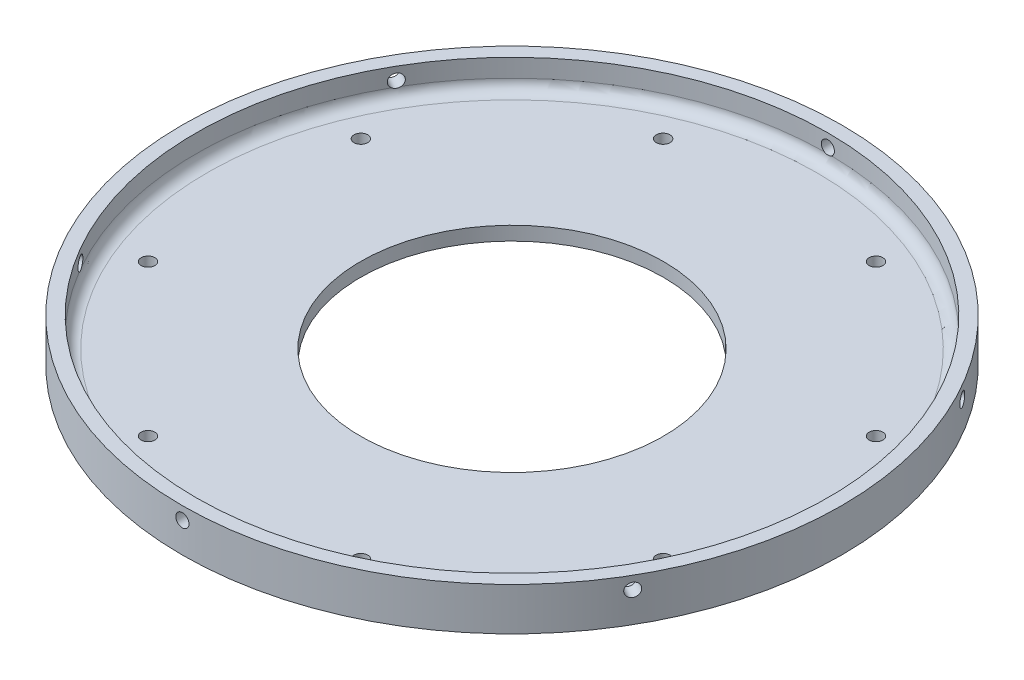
ISO-10303-21;
HEADER;
FILE_DESCRIPTION(('STEP AP214'),'2;1');
FILE_NAME('part.step','',(''),(''),'','','');
FILE_SCHEMA(('AUTOMOTIVE_DESIGN { 1 0 10303 214 1 1 1 1 }'));
ENDSEC;
DATA;
#1=APPLICATION_CONTEXT('core data for automotive mechanical design processes');
#2=APPLICATION_PROTOCOL_DEFINITION('international standard','automotive_design',2000,#1);
#3=PRODUCT_CONTEXT('',#1,'mechanical');
#4=PRODUCT('Part','Part','',(#3));
#5=PRODUCT_RELATED_PRODUCT_CATEGORY('part','',(#4));
#6=PRODUCT_DEFINITION_FORMATION('','',#4);
#7=PRODUCT_DEFINITION_CONTEXT('part definition',#1,'design');
#8=PRODUCT_DEFINITION('design','',#6,#7);
#9=PRODUCT_DEFINITION_SHAPE('','',#8);
#10=(LENGTH_UNIT() NAMED_UNIT(*) SI_UNIT(.MILLI.,.METRE.));
#11=(NAMED_UNIT(*) PLANE_ANGLE_UNIT() SI_UNIT($,.RADIAN.));
#12=(NAMED_UNIT(*) SI_UNIT($,.STERADIAN.) SOLID_ANGLE_UNIT());
#13=UNCERTAINTY_MEASURE_WITH_UNIT(LENGTH_MEASURE(1.E-05),#10,'distance_accuracy_value','');
#14=(GEOMETRIC_REPRESENTATION_CONTEXT(3) GLOBAL_UNCERTAINTY_ASSIGNED_CONTEXT((#13)) GLOBAL_UNIT_ASSIGNED_CONTEXT((#10,
#11,#12)) REPRESENTATION_CONTEXT('',''));
#15=CARTESIAN_POINT('',(0.,0.,0.));
#16=DIRECTION('',(0.,0.,1.));
#17=DIRECTION('',(1.,0.,0.));
#18=AXIS2_PLACEMENT_3D('',#15,#16,#17);
#19=CARTESIAN_POINT('',(0.,-81.0912162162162,0.));
#20=DIRECTION('',(0.,-1.,0.));
#21=DIRECTION('',(0.,0.,-1.));
#22=AXIS2_PLACEMENT_3D('',#19,#20,#21);
#23=CYLINDRICAL_SURFACE('',#22,35.);
#24=CARTESIAN_POINT('',(0.,3.175,0.));
#25=DIRECTION('',(0.,-1.,0.));
#26=DIRECTION('',(0.,0.,-1.));
#27=AXIS2_PLACEMENT_3D('',#24,#25,#26);
#28=CIRCLE('',#27,35.);
#29=CARTESIAN_POINT('',(0.,3.175,-35.));
#30=VERTEX_POINT('',#29);
#31=EDGE_CURVE('E108',#30,#30,#28,.T.);
#32=ORIENTED_EDGE('',*,*,#31,.F.);
#33=EDGE_LOOP('',(#32));
#34=FACE_BOUND('',#33,.T.);
#35=CARTESIAN_POINT('',(0.,0.,0.));
#36=DIRECTION('',(0.,-1.,0.));
#37=DIRECTION('',(0.,0.,-1.));
#38=AXIS2_PLACEMENT_3D('',#35,#36,#37);
#39=CIRCLE('',#38,35.);
#40=CARTESIAN_POINT('',(0.,0.,-35.));
#41=VERTEX_POINT('',#40);
#42=EDGE_CURVE('E241',#41,#41,#39,.T.);
#43=ORIENTED_EDGE('',*,*,#42,.T.);
#44=EDGE_LOOP('',(#43));
#45=FACE_BOUND('',#44,.T.);
#46=ADVANCED_FACE('F35',(#34,#45),#23,.F.);
#47=CARTESIAN_POINT('',(-35.,3.175,0.));
#48=DIRECTION('',(0.,-1.,0.));
#49=DIRECTION('',(0.,0.,-1.));
#50=AXIS2_PLACEMENT_3D('',#47,#48,#49);
#51=PLANE('',#50);
#52=CARTESIAN_POINT('',(-24.6,3.175,-59.525));
#53=DIRECTION('',(0.,-1.,0.));
#54=DIRECTION('',(0.,0.,-1.));
#55=AXIS2_PLACEMENT_3D('',#52,#53,#54);
#56=CIRCLE('',#55,1.58749999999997);
#57=CARTESIAN_POINT('',(-24.6,3.175,-61.1125));
#58=VERTEX_POINT('',#57);
#59=EDGE_CURVE('E368',#58,#58,#56,.T.);
#60=ORIENTED_EDGE('',*,*,#59,.T.);
#61=EDGE_LOOP('',(#60));
#62=FACE_BOUND('',#61,.T.);
#63=CARTESIAN_POINT('',(24.6,3.175,-59.525));
#64=DIRECTION('',(0.,-1.,0.));
#65=DIRECTION('',(0.,0.,-1.));
#66=AXIS2_PLACEMENT_3D('',#63,#64,#65);
#67=CIRCLE('',#66,1.58749999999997);
#68=CARTESIAN_POINT('',(24.6,3.175,-61.1125));
#69=VERTEX_POINT('',#68);
#70=EDGE_CURVE('E364',#69,#69,#67,.T.);
#71=ORIENTED_EDGE('',*,*,#70,.T.);
#72=EDGE_LOOP('',(#71));
#73=FACE_BOUND('',#72,.T.);
#74=CARTESIAN_POINT('',(-59.525,3.175,-24.6));
#75=DIRECTION('',(0.,-1.,0.));
#76=DIRECTION('',(0.,0.,-1.));
#77=AXIS2_PLACEMENT_3D('',#74,#75,#76);
#78=CIRCLE('',#77,1.58749999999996);
#79=CARTESIAN_POINT('',(-59.525,3.175,-26.1875));
#80=VERTEX_POINT('',#79);
#81=EDGE_CURVE('E360',#80,#80,#78,.T.);
#82=ORIENTED_EDGE('',*,*,#81,.T.);
#83=EDGE_LOOP('',(#82));
#84=FACE_BOUND('',#83,.T.);
#85=CARTESIAN_POINT('',(-59.525,3.175,24.6));
#86=DIRECTION('',(0.,-1.,0.));
#87=DIRECTION('',(0.,0.,-1.));
#88=AXIS2_PLACEMENT_3D('',#85,#86,#87);
#89=CIRCLE('',#88,1.58749999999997);
#90=CARTESIAN_POINT('',(-59.525,3.175,23.0125));
#91=VERTEX_POINT('',#90);
#92=EDGE_CURVE('E356',#91,#91,#89,.T.);
#93=ORIENTED_EDGE('',*,*,#92,.T.);
#94=EDGE_LOOP('',(#93));
#95=FACE_BOUND('',#94,.T.);
#96=CARTESIAN_POINT('',(-24.6,3.175,59.525));
#97=DIRECTION('',(0.,-1.,0.));
#98=DIRECTION('',(0.,0.,-1.));
#99=AXIS2_PLACEMENT_3D('',#96,#97,#98);
#100=CIRCLE('',#99,1.58749999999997);
#101=CARTESIAN_POINT('',(-24.6,3.175,57.9375));
#102=VERTEX_POINT('',#101);
#103=EDGE_CURVE('E352',#102,#102,#100,.T.);
#104=ORIENTED_EDGE('',*,*,#103,.T.);
#105=EDGE_LOOP('',(#104));
#106=FACE_BOUND('',#105,.T.);
#107=CARTESIAN_POINT('',(24.6,3.175,59.525));
#108=DIRECTION('',(0.,-1.,0.));
#109=DIRECTION('',(0.,0.,-1.));
#110=AXIS2_PLACEMENT_3D('',#107,#108,#109);
#111=CIRCLE('',#110,1.58749999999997);
#112=CARTESIAN_POINT('',(24.6,3.175,57.9375));
#113=VERTEX_POINT('',#112);
#114=EDGE_CURVE('E348',#113,#113,#111,.T.);
#115=ORIENTED_EDGE('',*,*,#114,.T.);
#116=EDGE_LOOP('',(#115));
#117=FACE_BOUND('',#116,.T.);
#118=CARTESIAN_POINT('',(59.525,3.175,24.6));
#119=DIRECTION('',(0.,-1.,0.));
#120=DIRECTION('',(0.,0.,-1.));
#121=AXIS2_PLACEMENT_3D('',#118,#119,#120);
#122=CIRCLE('',#121,1.58749999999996);
#123=CARTESIAN_POINT('',(59.525,3.175,23.0125));
#124=VERTEX_POINT('',#123);
#125=EDGE_CURVE('E337',#124,#124,#122,.T.);
#126=ORIENTED_EDGE('',*,*,#125,.T.);
#127=EDGE_LOOP('',(#126));
#128=FACE_BOUND('',#127,.T.);
#129=CARTESIAN_POINT('',(59.525,3.175,-24.6));
#130=DIRECTION('',(0.,-1.,0.));
#131=DIRECTION('',(0.,0.,-1.));
#132=AXIS2_PLACEMENT_3D('',#129,#130,#131);
#133=CIRCLE('',#132,1.58749999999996);
#134=CARTESIAN_POINT('',(59.525,3.175,-26.1875));
#135=VERTEX_POINT('',#134);
#136=EDGE_CURVE('E103',#135,#135,#133,.T.);
#137=ORIENTED_EDGE('',*,*,#136,.T.);
#138=EDGE_LOOP('',(#137));
#139=FACE_BOUND('',#138,.T.);
#140=CARTESIAN_POINT('',(0.,3.175,0.));
#141=DIRECTION('',(0.,-1.,0.));
#142=DIRECTION('',(0.,0.,-1.));
#143=AXIS2_PLACEMENT_3D('',#140,#141,#142);
#144=CIRCLE('',#143,70.485);
#145=CARTESIAN_POINT('',(0.,3.175,-70.485));
#146=VERTEX_POINT('',#145);
#147=EDGE_CURVE('E117',#146,#146,#144,.F.);
#148=ORIENTED_EDGE('',*,*,#147,.T.);
#149=EDGE_LOOP('',(#148));
#150=FACE_BOUND('',#149,.T.);
#151=ORIENTED_EDGE('',*,*,#31,.T.);
#152=EDGE_LOOP('',(#151));
#153=FACE_BOUND('',#152,.T.);
#154=ADVANCED_FACE('F174',(#62,#73,#84,#95,#106,#117,#128,#139,#150,#153),#51,.F.);
#155=CARTESIAN_POINT('',(0.,-81.0912162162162,0.));
#156=DIRECTION('',(0.,-1.,0.));
#157=DIRECTION('',(0.,0.,-1.));
#158=AXIS2_PLACEMENT_3D('',#155,#156,#157);
#159=CYLINDRICAL_SURFACE('',#158,73.025);
#160=CARTESIAN_POINT('',(0.,5.715,0.));
#161=DIRECTION('',(0.,-1.,0.));
#162=DIRECTION('',(0.,0.,-1.));
#163=AXIS2_PLACEMENT_3D('',#160,#161,#162);
#164=CIRCLE('',#163,73.025);
#165=CARTESIAN_POINT('',(63.6534735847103,5.715,-35.789466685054));
#166=VERTEX_POINT('',#165);
#167=CARTESIAN_POINT('',(63.6635415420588,5.715,35.7715543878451));
#168=VERTEX_POINT('',#167);
#169=EDGE_CURVE('E101',#166,#168,#164,.T.);
#170=ORIENTED_EDGE('',*,*,#169,.T.);
#171=CARTESIAN_POINT('',(63.6635415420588,5.715,35.7715543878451));
#172=CARTESIAN_POINT('',(63.6810459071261,5.7387018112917,35.7404015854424));
#173=CARTESIAN_POINT('',(63.6980287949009,5.76390060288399,35.7101229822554));
#174=CARTESIAN_POINT('',(63.7308566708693,5.81712987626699,35.6515029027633));
#175=CARTESIAN_POINT('',(63.7467017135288,5.84516022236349,35.6231613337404));
#176=CARTESIAN_POINT('',(63.7923416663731,5.9331654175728,35.5414076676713));
#177=CARTESIAN_POINT('',(63.8202976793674,5.99713086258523,35.4911663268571));
#178=CARTESIAN_POINT('',(63.8705040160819,6.13380357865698,35.4007349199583));
#179=CARTESIAN_POINT('',(63.8927516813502,6.20651489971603,35.360549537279));
#180=CARTESIAN_POINT('',(63.930970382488,6.3586114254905,35.2914042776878));
#181=CARTESIAN_POINT('',(63.9469426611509,6.43799530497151,35.2624421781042));
#182=CARTESIAN_POINT('',(63.9722036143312,6.6011823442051,35.2165938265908));
#183=CARTESIAN_POINT('',(63.9814926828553,6.684985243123,35.1997068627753));
#184=CARTESIAN_POINT('',(63.993156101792,6.85465090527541,35.1784983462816));
#185=CARTESIAN_POINT('',(63.9955294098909,6.94051397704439,35.1741786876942));
#186=CARTESIAN_POINT('',(63.9932982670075,7.11182810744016,35.1782376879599));
#187=CARTESIAN_POINT('',(63.9886954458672,7.19727925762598,35.186613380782));
#188=CARTESIAN_POINT('',(63.9726318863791,7.36535882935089,35.215809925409));
#189=CARTESIAN_POINT('',(63.9611715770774,7.44798742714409,35.2366299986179));
#190=CARTESIAN_POINT('',(63.9316832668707,7.60808537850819,35.2901037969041));
#191=CARTESIAN_POINT('',(63.9136550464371,7.68555455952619,35.3227579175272));
#192=CARTESIAN_POINT('',(63.871490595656,7.83313468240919,35.3989435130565));
#193=CARTESIAN_POINT('',(63.8473542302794,7.90324546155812,35.4424752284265));
#194=CARTESIAN_POINT('',(63.7935909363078,8.0341307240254,35.5391535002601));
#195=CARTESIAN_POINT('',(63.7639629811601,8.09490345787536,35.5923018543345));
#196=CARTESIAN_POINT('',(63.6999940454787,8.20537223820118,35.7066613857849));
#197=CARTESIAN_POINT('',(63.6656530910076,8.25506834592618,35.7678725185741));
#198=CARTESIAN_POINT('',(63.5931670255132,8.34197709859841,35.8965901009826));
#199=CARTESIAN_POINT('',(63.5550216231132,8.37918878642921,35.9640970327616));
#200=CARTESIAN_POINT('',(63.4759598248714,8.44006634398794,36.1034563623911));
#201=CARTESIAN_POINT('',(63.4350434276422,8.46373220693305,36.1753087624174));
#202=CARTESIAN_POINT('',(63.3515731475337,8.49684265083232,36.3212867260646));
#203=CARTESIAN_POINT('',(63.3090195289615,8.50628951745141,36.3954119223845));
#204=CARTESIAN_POINT('',(63.2234624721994,8.51070060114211,36.5438333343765));
#205=CARTESIAN_POINT('',(63.1804590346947,8.50566484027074,36.618129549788));
#206=CARTESIAN_POINT('',(63.0952373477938,8.48125566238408,36.7647772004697));
#207=CARTESIAN_POINT('',(63.0530189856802,8.46188432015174,36.8371289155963));
#208=CARTESIAN_POINT('',(62.970588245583,8.40935677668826,36.9778622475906));
#209=CARTESIAN_POINT('',(62.9303758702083,8.37620055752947,37.0462438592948));
#210=CARTESIAN_POINT('',(62.8531413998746,8.29704097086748,37.1771303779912));
#211=CARTESIAN_POINT('',(62.8161196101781,8.25103637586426,37.2396347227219));
#212=CARTESIAN_POINT('',(62.7463806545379,8.14748710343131,37.3570208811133));
#213=CARTESIAN_POINT('',(62.7136634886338,8.08994242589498,37.4119026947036));
#214=CARTESIAN_POINT('',(62.6535220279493,7.96493374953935,37.5125345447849));
#215=CARTESIAN_POINT('',(62.6260987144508,7.89746791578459,37.5582828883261));
#216=CARTESIAN_POINT('',(62.5773953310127,7.75453907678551,37.6393738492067));
#217=CARTESIAN_POINT('',(62.5561152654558,7.67907606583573,37.6747164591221));
#218=CARTESIAN_POINT('',(62.5203588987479,7.5222960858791,37.7340238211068));
#219=CARTESIAN_POINT('',(62.5058824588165,7.44097923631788,37.7579888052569));
#220=CARTESIAN_POINT('',(62.484184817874,7.27479783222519,37.7938846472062));
#221=CARTESIAN_POINT('',(62.4769636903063,7.18993324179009,37.8058153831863));
#222=CARTESIAN_POINT('',(62.4700039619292,7.01908015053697,37.817314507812));
#223=CARTESIAN_POINT('',(62.4702642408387,6.9330918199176,37.8168847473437));
#224=CARTESIAN_POINT('',(62.478256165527,6.76242810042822,37.8036795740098));
#225=CARTESIAN_POINT('',(62.4859871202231,6.67775259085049,37.7909053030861));
#226=CARTESIAN_POINT('',(62.5086733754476,6.51213266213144,37.7533687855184));
#227=CARTESIAN_POINT('',(62.5236267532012,6.43118725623,37.7286097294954));
#228=CARTESIAN_POINT('',(62.5603017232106,6.27525844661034,37.6677650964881));
#229=CARTESIAN_POINT('',(62.5820266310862,6.20027798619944,37.6316739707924));
#230=CARTESIAN_POINT('',(62.6315856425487,6.0583884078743,37.5491334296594));
#231=CARTESIAN_POINT('',(62.6594258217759,5.99148742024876,37.5026737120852));
#232=CARTESIAN_POINT('',(62.7203100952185,5.86784852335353,37.4007595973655));
#233=CARTESIAN_POINT('',(62.753342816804,5.81108896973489,37.3453248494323));
#234=CARTESIAN_POINT('',(62.7992137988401,5.74456338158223,37.2680805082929));
#235=CARTESIAN_POINT('',(62.810179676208,5.72949353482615,37.2495965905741));
#236=CARTESIAN_POINT('',(62.8213241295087,5.715,37.230791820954));
#237=B_SPLINE_CURVE_WITH_KNOTS('',3,(#171,#172,#173,#174,#175,#176,#177,#178,#179,#180,#181,
#182,#183,#184,#185,#186,#187,#188,#189,#190,#191,#192,#193,#194,#195,#196,#197,#198,#199,#200,
#201,#202,#203,#204,#205,#206,#207,#208,#209,#210,#211,#212,#213,#214,#215,#216,#217,#218,#219,
#220,#221,#222,#223,#224,#225,#226,#227,#228,#229,#230,#231,#232,#233,#234,#235,#236),
.UNSPECIFIED.,.F.,.F.,(4,2,2,2,2,2,2,2,2,2,2,2,2,2,2,2,2,2,2,2,2,2,2,2,2,2,2,2,2,2,2,2,4),(0.,
0.128560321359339,0.257114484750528,0.513813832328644,0.770632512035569,1.02740030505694,
1.2841529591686,1.54094430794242,1.79767567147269,2.05439097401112,2.31111485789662,
2.56784441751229,2.8246220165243,3.08139819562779,3.33819405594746,3.59499004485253,
3.85174475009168,4.10849906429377,4.36521622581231,4.62193372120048,4.87867575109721,
5.13541778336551,5.39220736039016,5.64899712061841,5.90578164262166,6.16256876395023,
6.419317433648,6.67604235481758,6.93269896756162,7.18948144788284,7.44652020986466,
7.70300365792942,7.78171187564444),.UNSPECIFIED.);
#238=CARTESIAN_POINT('',(62.8213241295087,5.715,37.2307918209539));
#239=VERTEX_POINT('',#238);
#240=EDGE_CURVE('E54',#168,#239,#237,.T.);
#241=ORIENTED_EDGE('',*,*,#240,.T.);
#242=CARTESIAN_POINT('',(0.852695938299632,5.715,73.0200214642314));
#243=VERTEX_POINT('',#242);
#244=EDGE_CURVE('E99',#239,#243,#164,.T.);
#245=ORIENTED_EDGE('',*,*,#244,.T.);
#246=CARTESIAN_POINT('',(0.852695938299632,5.715,73.0200214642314));
#247=CARTESIAN_POINT('',(0.888427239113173,5.73870181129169,73.0196042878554));
#248=CARTESIAN_POINT('',(0.923140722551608,5.76390060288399,73.0191725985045));
#249=CARTESIAN_POINT('',(0.990321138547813,5.81712987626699,73.0182923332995));
#250=CARTESIAN_POINT('',(1.02278817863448,5.8451602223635,73.0178437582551));
#251=CARTESIAN_POINT('',(1.11640890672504,5.9331654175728,73.0164922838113));
#252=CARTESIAN_POINT('',(1.17389719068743,5.99713086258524,73.0155822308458));
#253=CARTESIAN_POINT('',(1.27731625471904,6.13380357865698,73.013846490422));
#254=CARTESIAN_POINT('',(1.32324164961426,6.20651489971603,73.0130208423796));
#255=CARTESIAN_POINT('',(1.40223255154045,6.3586114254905,73.011546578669));
#256=CARTESIAN_POINT('',(1.43530060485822,6.43799530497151,73.0108979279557));
#257=CARTESIAN_POINT('',(1.48763691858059,6.60118234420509,73.0098503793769));
#258=CARTESIAN_POINT('',(1.50690599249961,6.684985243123,73.0094514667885));
#259=CARTESIAN_POINT('',(1.53110481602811,6.8546509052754,73.0089480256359));
#260=CARTESIAN_POINT('',(1.53603240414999,6.94051397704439,73.0088435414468));
#261=CARTESIAN_POINT('',(1.53140163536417,7.11182810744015,73.0089408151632));
#262=CARTESIAN_POINT('',(1.52184666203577,7.19727925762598,73.0091425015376));
#263=CARTESIAN_POINT('',(1.488529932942,7.36535882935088,73.0098293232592));
#264=CARTESIAN_POINT('',(1.46476906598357,7.44798742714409,73.0103144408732));
#265=CARTESIAN_POINT('',(1.40371524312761,7.60808537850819,73.0115137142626));
#266=CARTESIAN_POINT('',(1.36642183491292,7.68555455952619,73.0122278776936));
#267=CARTESIAN_POINT('',(1.27936094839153,7.83313468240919,73.0138051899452));
#268=CARTESIAN_POINT('',(1.2295931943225,7.90324546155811,73.0146683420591));
#269=CARTESIAN_POINT('',(1.11898570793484,8.0341307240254,73.0164470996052));
#270=CARTESIAN_POINT('',(1.05814390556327,8.09490345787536,73.0173627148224));
#271=CARTESIAN_POINT('',(0.927121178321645,8.20537223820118,73.0191437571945));
#272=CARTESIAN_POINT('',(0.8569403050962,8.25506834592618,73.0200091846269));
#273=CARTESIAN_POINT('',(0.709224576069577,8.3419770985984,73.0215932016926));
#274=CARTESIAN_POINT('',(0.631689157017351,8.37918878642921,73.0223117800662));
#275=CARTESIAN_POINT('',(0.471469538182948,8.44006634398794,73.0235219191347));
#276=CARTESIAN_POINT('',(0.388785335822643,8.46373220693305,73.024013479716));
#277=CARTESIAN_POINT('',(0.220629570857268,8.49684265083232,73.0247150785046));
#278=CARTESIAN_POINT('',(0.135158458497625,8.50628951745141,73.024925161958));
#279=CARTESIAN_POINT('',(-0.0361567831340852,8.5107006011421,73.025041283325));
#280=CARTESIAN_POINT('',(-0.12200091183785,8.50566484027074,73.0249473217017));
#281=CARTESIAN_POINT('',(-0.291612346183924,8.48125566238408,73.0244670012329));
#282=CARTESIAN_POINT('',(-0.37537995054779,8.46188432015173,73.0240806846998));
#283=CARTESIAN_POINT('',(-0.53847396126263,8.40935677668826,73.02306023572));
#284=CARTESIAN_POINT('',(-0.617800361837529,8.37620055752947,73.0224261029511));
#285=CARTESIAN_POINT('',(-0.769768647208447,8.29704097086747,73.0209823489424));
#286=CARTESIAN_POINT('',(-0.842409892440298,8.25103637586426,73.0201727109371));
#287=CARTESIAN_POINT('',(-0.978938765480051,8.14748710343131,73.0184700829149));
#288=CARTESIAN_POINT('',(-1.04282639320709,8.08994242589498,73.0175770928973));
#289=CARTESIAN_POINT('',(-1.16004686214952,7.96493374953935,73.0158089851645));
#290=CARTESIAN_POINT('',(-1.21337774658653,7.89746791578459,73.0149338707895));
#291=CARTESIAN_POINT('',(-1.30795627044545,7.75453907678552,73.013300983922));
#292=CARTESIAN_POINT('',(-1.34920390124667,7.67907606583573,73.0125432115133));
#293=CARTESIAN_POINT('',(-1.41844376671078,7.52229608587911,73.0112309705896));
#294=CARTESIAN_POINT('',(-1.44643627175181,7.44097923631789,73.0106764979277));
#295=CARTESIAN_POINT('',(-1.4883718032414,7.2747978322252,73.009833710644));
#296=CARTESIAN_POINT('',(-1.50231468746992,7.18993324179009,73.0095453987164));
#297=CARTESIAN_POINT('',(-1.51575308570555,7.01908015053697,73.0092676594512));
#298=CARTESIAN_POINT('',(-1.51525076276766,6.9330918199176,73.0092781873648));
#299=CARTESIAN_POINT('',(-1.49981878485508,6.76242810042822,73.009596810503));
#300=CARTESIAN_POINT('',(-1.48489046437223,6.67775259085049,73.0099048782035));
#301=CARTESIAN_POINT('',(-1.44103975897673,6.51213266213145,73.0107834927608));
#302=CARTESIAN_POINT('',(-1.41212109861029,6.43118725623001,73.0113539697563));
#303=CARTESIAN_POINT('',(-1.3410906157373,6.27525844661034,73.0126931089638));
#304=CARTESIAN_POINT('',(-1.29897233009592,6.20027798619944,73.0134618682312));
#305=CARTESIAN_POINT('',(-1.20271061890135,6.0583884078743,73.0151109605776));
#306=CARTESIAN_POINT('',(-1.14855523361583,5.99148742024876,73.0159914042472));
#307=CARTESIAN_POINT('',(-1.02985288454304,5.86784852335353,73.0177616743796));
#308=CARTESIAN_POINT('',(-0.965328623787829,5.81108896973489,73.0186514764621));
#309=CARTESIAN_POINT('',(-0.875497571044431,5.74456338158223,73.0197547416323));
#310=CARTESIAN_POINT('',(-0.854007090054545,5.72949353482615,73.0200095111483));
#311=CARTESIAN_POINT('',(-0.832149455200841,5.715,73.0202585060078));
#312=B_SPLINE_CURVE_WITH_KNOTS('',3,(#246,#247,#248,#249,#250,#251,#252,#253,#254,#255,#256,
#257,#258,#259,#260,#261,#262,#263,#264,#265,#266,#267,#268,#269,#270,#271,#272,#273,#274,#275,
#276,#277,#278,#279,#280,#281,#282,#283,#284,#285,#286,#287,#288,#289,#290,#291,#292,#293,#294,
#295,#296,#297,#298,#299,#300,#301,#302,#303,#304,#305,#306,#307,#308,#309,#310,#311),
.UNSPECIFIED.,.F.,.F.,(4,2,2,2,2,2,2,2,2,2,2,2,2,2,2,2,2,2,2,2,2,2,2,2,2,2,2,2,2,2,2,2,4),(0.,
0.128560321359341,0.257114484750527,0.513813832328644,0.770632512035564,1.02740030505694,
1.2841529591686,1.54094430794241,1.79767567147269,2.05439097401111,2.31111485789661,
2.56784441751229,2.82462201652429,3.08139819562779,3.33819405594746,3.59499004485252,
3.85174475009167,4.10849906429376,4.36521622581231,4.62193372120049,4.87867575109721,
5.1354177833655,5.39220736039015,5.64899712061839,5.90578164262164,6.16256876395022,
6.41931743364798,6.67604235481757,6.93269896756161,7.18948144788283,7.44652020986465,
7.7030036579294,7.78171187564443),.UNSPECIFIED.);
#313=CARTESIAN_POINT('',(-0.832149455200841,5.715,73.0202585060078));
#314=VERTEX_POINT('',#313);
#315=EDGE_CURVE('E178',#243,#314,#312,.T.);
#316=ORIENTED_EDGE('',*,*,#315,.T.);
#317=CARTESIAN_POINT('',(-62.8108456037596,5.715,37.2484670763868));
#318=VERTEX_POINT('',#317);
#319=EDGE_CURVE('E110',#314,#318,#164,.T.);
#320=ORIENTED_EDGE('',*,*,#319,.T.);
#321=CARTESIAN_POINT('',(-62.8108456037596,5.715,37.2484670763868));
#322=CARTESIAN_POINT('',(-62.7926186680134,5.7387018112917,37.2792027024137));
#323=CARTESIAN_POINT('',(-62.7748880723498,5.76390060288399,37.3090496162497));
#324=CARTESIAN_POINT('',(-62.740535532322,5.81712987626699,37.3667894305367));
#325=CARTESIAN_POINT('',(-62.7239135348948,5.84516022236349,37.3946824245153));
#326=CARTESIAN_POINT('',(-62.6759327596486,5.9331654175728,37.4750846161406));
#327=CARTESIAN_POINT('',(-62.6464004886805,5.99713086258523,37.5244159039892));
#328=CARTESIAN_POINT('',(-62.5931877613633,6.13380357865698,37.6131115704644));
#329=CARTESIAN_POINT('',(-62.5695100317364,6.20651489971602,37.6524713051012));
#330=CARTESIAN_POINT('',(-62.5287378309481,6.3586114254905,37.7201423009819));
#331=CARTESIAN_POINT('',(-62.5116420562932,6.43799530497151,37.7484557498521));
#332=CARTESIAN_POINT('',(-62.4845666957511,6.60118234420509,37.7932565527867));
#333=CARTESIAN_POINT('',(-62.4745866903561,6.684985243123,37.8097446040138));
#334=CARTESIAN_POINT('',(-62.4620512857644,6.8546509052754,37.8304496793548));
#335=CARTESIAN_POINT('',(-62.4594970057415,6.94051397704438,37.8346648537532));
#336=CARTESIAN_POINT('',(-62.4618966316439,7.11182810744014,37.8307031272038));
#337=CARTESIAN_POINT('',(-62.4668487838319,7.19727925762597,37.8225291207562));
#338=CARTESIAN_POINT('',(-62.4841019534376,7.36535882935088,37.7940193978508));
#339=CARTESIAN_POINT('',(-62.4964025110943,7.44798742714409,37.7736844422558));
#340=CARTESIAN_POINT('',(-62.5279680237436,7.60808537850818,37.7214099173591));
#341=CARTESIAN_POINT('',(-62.5472332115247,7.68555455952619,37.689469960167));
#342=CARTESIAN_POINT('',(-62.5921296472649,7.83313468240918,37.6148616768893));
#343=CARTESIAN_POINT('',(-62.6177610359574,7.90324546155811,37.5721931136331));
#344=CARTESIAN_POINT('',(-62.6746052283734,8.0341307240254,37.4772935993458));
#345=CARTESIAN_POINT('',(-62.7058190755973,8.09490345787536,37.4250608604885));
#346=CARTESIAN_POINT('',(-62.7728728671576,8.20537223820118,37.3124823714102));
#347=CARTESIAN_POINT('',(-62.8087127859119,8.25506834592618,37.2521366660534));
#348=CARTESIAN_POINT('',(-62.8839424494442,8.3419770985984,37.1250031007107));
#349=CARTESIAN_POINT('',(-62.9233324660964,8.37918878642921,37.0582147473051));
#350=CARTESIAN_POINT('',(-63.004490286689,8.44006634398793,36.9200655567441));
#351=CARTESIAN_POINT('',(-63.0462580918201,8.46373220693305,36.8487047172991));
#352=CARTESIAN_POINT('',(-63.130943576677,8.49684265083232,36.7034283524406));
#353=CARTESIAN_POINT('',(-63.1738610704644,8.50628951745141,36.6295132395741));
#354=CARTESIAN_POINT('',(-63.259619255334,8.51070060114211,36.4812079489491));
#355=CARTESIAN_POINT('',(-63.302459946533,8.50566484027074,36.4068177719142));
#356=CARTESIAN_POINT('',(-63.3868496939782,8.48125566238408,36.2596898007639));
#357=CARTESIAN_POINT('',(-63.4283989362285,8.46188432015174,36.186951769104));
#358=CARTESIAN_POINT('',(-63.5090622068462,8.40935677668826,36.04519798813));
#359=CARTESIAN_POINT('',(-63.5481762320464,8.37620055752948,35.9761822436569));
#360=CARTESIAN_POINT('',(-63.6229100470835,8.29704097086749,35.8438519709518));
#361=CARTESIAN_POINT('',(-63.6585295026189,8.25103637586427,35.7805379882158));
#362=CARTESIAN_POINT('',(-63.7253194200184,8.14748710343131,35.6614492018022));
#363=CARTESIAN_POINT('',(-63.7564898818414,8.08994242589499,35.6056743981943));
#364=CARTESIAN_POINT('',(-63.8135688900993,7.96493374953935,35.5032744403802));
#365=CARTESIAN_POINT('',(-63.8394764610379,7.8974679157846,35.4566509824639));
#366=CARTESIAN_POINT('',(-63.8853516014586,7.75453907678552,35.373927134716));
#367=CARTESIAN_POINT('',(-63.905319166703,7.67907606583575,35.3378267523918));
#368=CARTESIAN_POINT('',(-63.9388026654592,7.52229608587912,35.2772071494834));
#369=CARTESIAN_POINT('',(-63.9523187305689,7.4409792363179,35.2526876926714));
#370=CARTESIAN_POINT('',(-63.9725566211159,7.27479783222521,35.2159490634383));
#371=CARTESIAN_POINT('',(-63.9792783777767,7.1899332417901,35.2037300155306));
#372=CARTESIAN_POINT('',(-63.9857570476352,7.01908015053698,35.1919531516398));
#373=CARTESIAN_POINT('',(-63.9855150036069,6.93309181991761,35.1923934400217));
#374=CARTESIAN_POINT('',(-63.9780749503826,6.76242810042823,35.2059172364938));
#375=CARTESIAN_POINT('',(-63.9708775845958,6.6777525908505,35.2189995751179));
#376=CARTESIAN_POINT('',(-63.9497131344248,6.51213266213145,35.257414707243));
#377=CARTESIAN_POINT('',(-63.935747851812,6.43118725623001,35.2827442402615));
#378=CARTESIAN_POINT('',(-63.9013923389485,6.27525844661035,35.3449280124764));
#379=CARTESIAN_POINT('',(-63.8809989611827,6.20027798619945,35.3817878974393));
#380=CARTESIAN_POINT('',(-63.8342962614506,6.05838840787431,35.4659775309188));
#381=CARTESIAN_POINT('',(-63.8079810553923,5.99148742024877,35.5133176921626));
#382=CARTESIAN_POINT('',(-63.7501629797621,5.86784852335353,35.6170020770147));
#383=CARTESIAN_POINT('',(-63.7186714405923,5.81108896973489,35.6733266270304));
#384=CARTESIAN_POINT('',(-63.6747113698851,5.74456338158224,35.7516742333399));
#385=CARTESIAN_POINT('',(-63.6641867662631,5.72949353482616,35.7704129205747));
#386=CARTESIAN_POINT('',(-63.65347358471,5.715,35.7894666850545));
#387=B_SPLINE_CURVE_WITH_KNOTS('',3,(#321,#322,#323,#324,#325,#326,#327,#328,#329,#330,#331,
#332,#333,#334,#335,#336,#337,#338,#339,#340,#341,#342,#343,#344,#345,#346,#347,#348,#349,#350,
#351,#352,#353,#354,#355,#356,#357,#358,#359,#360,#361,#362,#363,#364,#365,#366,#367,#368,#369,
#370,#371,#372,#373,#374,#375,#376,#377,#378,#379,#380,#381,#382,#383,#384,#385,#386),
.UNSPECIFIED.,.F.,.F.,(4,2,2,2,2,2,2,2,2,2,2,2,2,2,2,2,2,2,2,2,2,2,2,2,2,2,2,2,2,2,2,2,4),(0.,
0.128560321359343,0.257114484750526,0.51381383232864,0.77063251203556,1.02740030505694,
1.28415295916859,1.54094430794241,1.79767567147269,2.05439097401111,2.31111485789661,
2.56784441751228,2.82462201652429,3.0813981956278,3.33819405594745,3.59499004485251,
3.85174475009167,4.10849906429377,4.3652162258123,4.62193372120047,4.87867575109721,
5.1354177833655,5.39220736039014,5.64899712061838,5.90578164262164,6.16256876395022,
6.41931743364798,6.67604235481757,6.93269896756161,7.18948144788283,7.44652020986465,
7.7030036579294,7.78171187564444),.UNSPECIFIED.);
#388=CARTESIAN_POINT('',(-63.65347358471,5.715,35.7894666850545));
#389=VERTEX_POINT('',#388);
#390=EDGE_CURVE('E188',#318,#389,#387,.T.);
#391=ORIENTED_EDGE('',*,*,#390,.T.);
#392=CARTESIAN_POINT('',(-63.663541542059,5.715,-35.7715543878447));
#393=VERTEX_POINT('',#392);
#394=EDGE_CURVE('E118',#389,#393,#164,.T.);
#395=ORIENTED_EDGE('',*,*,#394,.T.);
#396=CARTESIAN_POINT('',(-63.663541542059,5.715,-35.7715543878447));
#397=CARTESIAN_POINT('',(-63.6810459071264,5.7387018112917,-35.7404015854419));
#398=CARTESIAN_POINT('',(-63.6980287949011,5.76390060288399,-35.710122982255));
#399=CARTESIAN_POINT('',(-63.7308566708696,5.81712987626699,-35.6515029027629));
#400=CARTESIAN_POINT('',(-63.746701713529,5.84516022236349,-35.62316133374));
#401=CARTESIAN_POINT('',(-63.7923416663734,5.9331654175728,-35.5414076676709));
#402=CARTESIAN_POINT('',(-63.8202976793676,5.99713086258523,-35.4911663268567));
#403=CARTESIAN_POINT('',(-63.8705040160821,6.13380357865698,-35.4007349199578));
#404=CARTESIAN_POINT('',(-63.8927516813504,6.20651489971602,-35.3605495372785));
#405=CARTESIAN_POINT('',(-63.9309703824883,6.3586114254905,-35.2914042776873));
#406=CARTESIAN_POINT('',(-63.9469426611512,6.4379953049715,-35.2624421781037));
#407=CARTESIAN_POINT('',(-63.9722036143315,6.60118234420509,-35.2165938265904));
#408=CARTESIAN_POINT('',(-63.9814926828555,6.68498524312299,-35.1997068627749));
#409=CARTESIAN_POINT('',(-63.9931561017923,6.8546509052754,-35.1784983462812));
#410=CARTESIAN_POINT('',(-63.9955294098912,6.94051397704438,-35.1741786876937));
#411=CARTESIAN_POINT('',(-63.9932982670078,7.11182810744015,-35.1782376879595));
#412=CARTESIAN_POINT('',(-63.9886954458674,7.19727925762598,-35.1866133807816));
#413=CARTESIAN_POINT('',(-63.9726318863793,7.36535882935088,-35.2158099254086));
#414=CARTESIAN_POINT('',(-63.9611715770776,7.44798742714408,-35.2366299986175));
#415=CARTESIAN_POINT('',(-63.931683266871,7.60808537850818,-35.2901037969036));
#416=CARTESIAN_POINT('',(-63.9136550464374,7.68555455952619,-35.3227579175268));
#417=CARTESIAN_POINT('',(-63.8714905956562,7.83313468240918,-35.3989435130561));
#418=CARTESIAN_POINT('',(-63.8473542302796,7.90324546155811,-35.4424752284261));
#419=CARTESIAN_POINT('',(-63.793590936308,8.0341307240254,-35.5391535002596));
#420=CARTESIAN_POINT('',(-63.7639629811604,8.09490345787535,-35.592301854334));
#421=CARTESIAN_POINT('',(-63.699994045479,8.20537223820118,-35.7066613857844));
#422=CARTESIAN_POINT('',(-63.6656530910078,8.25506834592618,-35.7678725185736));
#423=CARTESIAN_POINT('',(-63.5931670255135,8.3419770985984,-35.8965901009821));
#424=CARTESIAN_POINT('',(-63.5550216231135,8.37918878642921,-35.9640970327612));
#425=CARTESIAN_POINT('',(-63.4759598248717,8.44006634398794,-36.1034563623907));
#426=CARTESIAN_POINT('',(-63.4350434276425,8.46373220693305,-36.175308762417));
#427=CARTESIAN_POINT('',(-63.351573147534,8.49684265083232,-36.3212867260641));
#428=CARTESIAN_POINT('',(-63.3090195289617,8.50628951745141,-36.395411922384));
#429=CARTESIAN_POINT('',(-63.2234624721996,8.51070060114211,-36.543833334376));
#430=CARTESIAN_POINT('',(-63.1804590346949,8.50566484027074,-36.6181295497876));
#431=CARTESIAN_POINT('',(-63.095237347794,8.48125566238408,-36.7647772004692));
#432=CARTESIAN_POINT('',(-63.0530189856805,8.46188432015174,-36.8371289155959));
#433=CARTESIAN_POINT('',(-62.9705882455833,8.40935677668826,-36.9778622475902));
#434=CARTESIAN_POINT('',(-62.9303758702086,8.37620055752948,-37.0462438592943));
#435=CARTESIAN_POINT('',(-62.8531413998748,8.29704097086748,-37.1771303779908));
#436=CARTESIAN_POINT('',(-62.8161196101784,8.25103637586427,-37.2396347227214));
#437=CARTESIAN_POINT('',(-62.7463806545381,8.14748710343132,-37.3570208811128));
#438=CARTESIAN_POINT('',(-62.7136634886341,8.08994242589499,-37.4119026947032));
#439=CARTESIAN_POINT('',(-62.6535220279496,7.96493374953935,-37.5125345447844));
#440=CARTESIAN_POINT('',(-62.6260987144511,7.8974679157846,-37.5582828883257));
#441=CARTESIAN_POINT('',(-62.5773953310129,7.75453907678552,-37.6393738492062));
#442=CARTESIAN_POINT('',(-62.5561152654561,7.67907606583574,-37.6747164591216));
#443=CARTESIAN_POINT('',(-62.5203588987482,7.52229608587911,-37.7340238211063));
#444=CARTESIAN_POINT('',(-62.5058824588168,7.44097923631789,-37.7579888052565));
#445=CARTESIAN_POINT('',(-62.4841848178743,7.2747978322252,-37.7938846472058));
#446=CARTESIAN_POINT('',(-62.4769636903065,7.1899332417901,-37.8058153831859));
#447=CARTESIAN_POINT('',(-62.4700039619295,7.01908015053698,-37.8173145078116));
#448=CARTESIAN_POINT('',(-62.470264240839,6.93309181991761,-37.8168847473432));
#449=CARTESIAN_POINT('',(-62.4782561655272,6.76242810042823,-37.8036795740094));
#450=CARTESIAN_POINT('',(-62.4859871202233,6.6777525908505,-37.7909053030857));
#451=CARTESIAN_POINT('',(-62.5086733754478,6.51213266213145,-37.7533687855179));
#452=CARTESIAN_POINT('',(-62.5236267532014,6.43118725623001,-37.7286097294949));
#453=CARTESIAN_POINT('',(-62.5603017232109,6.27525844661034,-37.6677650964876));
#454=CARTESIAN_POINT('',(-62.5820266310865,6.20027798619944,-37.631673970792));
#455=CARTESIAN_POINT('',(-62.631585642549,6.05838840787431,-37.549133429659));
#456=CARTESIAN_POINT('',(-62.6594258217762,5.99148742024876,-37.5026737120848));
#457=CARTESIAN_POINT('',(-62.7203100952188,5.86784852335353,-37.400759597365));
#458=CARTESIAN_POINT('',(-62.7533428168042,5.81108896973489,-37.3453248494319));
#459=CARTESIAN_POINT('',(-62.7992137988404,5.74456338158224,-37.2680805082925));
#460=CARTESIAN_POINT('',(-62.8101796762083,5.72949353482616,-37.2495965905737));
#461=CARTESIAN_POINT('',(-62.8213241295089,5.715,-37.2307918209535));
#462=B_SPLINE_CURVE_WITH_KNOTS('',3,(#396,#397,#398,#399,#400,#401,#402,#403,#404,#405,#406,
#407,#408,#409,#410,#411,#412,#413,#414,#415,#416,#417,#418,#419,#420,#421,#422,#423,#424,#425,
#426,#427,#428,#429,#430,#431,#432,#433,#434,#435,#436,#437,#438,#439,#440,#441,#442,#443,#444,
#445,#446,#447,#448,#449,#450,#451,#452,#453,#454,#455,#456,#457,#458,#459,#460,#461),
.UNSPECIFIED.,.F.,.F.,(4,2,2,2,2,2,2,2,2,2,2,2,2,2,2,2,2,2,2,2,2,2,2,2,2,2,2,2,2,2,2,2,4),(0.,
0.128560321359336,0.257114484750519,0.513813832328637,0.770632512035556,1.02740030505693,
1.28415295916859,1.54094430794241,1.79767567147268,2.0543909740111,2.31111485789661,
2.56784441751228,2.82462201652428,3.08139819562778,3.33819405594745,3.59499004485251,
3.85174475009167,4.10849906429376,4.36521622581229,4.62193372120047,4.8786757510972,
5.13541778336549,5.39220736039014,5.64899712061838,5.90578164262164,6.16256876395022,
6.41931743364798,6.67604235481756,6.9326989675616,7.18948144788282,7.44652020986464,
7.7030036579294,7.78171187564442),.UNSPECIFIED.);
#463=CARTESIAN_POINT('',(-62.8213241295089,5.715,-37.2307918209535));
#464=VERTEX_POINT('',#463);
#465=EDGE_CURVE('E196',#393,#464,#462,.T.);
#466=ORIENTED_EDGE('',*,*,#465,.T.);
#467=CARTESIAN_POINT('',(-0.852695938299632,5.715,-73.0200214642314));
#468=VERTEX_POINT('',#467);
#469=EDGE_CURVE('E122',#464,#468,#164,.T.);
#470=ORIENTED_EDGE('',*,*,#469,.T.);
#471=CARTESIAN_POINT('',(-0.852695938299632,5.715,-73.0200214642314));
#472=CARTESIAN_POINT('',(-0.888427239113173,5.73870181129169,-73.0196042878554));
#473=CARTESIAN_POINT('',(-0.923140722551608,5.76390060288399,-73.0191725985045));
#474=CARTESIAN_POINT('',(-0.990321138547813,5.81712987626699,-73.0182923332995));
#475=CARTESIAN_POINT('',(-1.02278817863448,5.8451602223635,-73.0178437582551));
#476=CARTESIAN_POINT('',(-1.11640890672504,5.9331654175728,-73.0164922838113));
#477=CARTESIAN_POINT('',(-1.17389719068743,5.99713086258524,-73.0155822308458));
#478=CARTESIAN_POINT('',(-1.27731625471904,6.13380357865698,-73.013846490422));
#479=CARTESIAN_POINT('',(-1.32324164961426,6.20651489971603,-73.0130208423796));
#480=CARTESIAN_POINT('',(-1.40223255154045,6.3586114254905,-73.011546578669));
#481=CARTESIAN_POINT('',(-1.43530060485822,6.43799530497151,-73.0108979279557));
#482=CARTESIAN_POINT('',(-1.48763691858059,6.60118234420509,-73.0098503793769));
#483=CARTESIAN_POINT('',(-1.50690599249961,6.684985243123,-73.0094514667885));
#484=CARTESIAN_POINT('',(-1.53110481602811,6.8546509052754,-73.0089480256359));
#485=CARTESIAN_POINT('',(-1.53603240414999,6.94051397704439,-73.0088435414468));
#486=CARTESIAN_POINT('',(-1.53140163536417,7.11182810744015,-73.0089408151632));
#487=CARTESIAN_POINT('',(-1.52184666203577,7.19727925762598,-73.0091425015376));
#488=CARTESIAN_POINT('',(-1.488529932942,7.36535882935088,-73.0098293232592));
#489=CARTESIAN_POINT('',(-1.46476906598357,7.44798742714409,-73.0103144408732));
#490=CARTESIAN_POINT('',(-1.40371524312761,7.60808537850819,-73.0115137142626));
#491=CARTESIAN_POINT('',(-1.36642183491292,7.68555455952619,-73.0122278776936));
#492=CARTESIAN_POINT('',(-1.27936094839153,7.83313468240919,-73.0138051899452));
#493=CARTESIAN_POINT('',(-1.2295931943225,7.90324546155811,-73.0146683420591));
#494=CARTESIAN_POINT('',(-1.11898570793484,8.0341307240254,-73.0164470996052));
#495=CARTESIAN_POINT('',(-1.05814390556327,8.09490345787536,-73.0173627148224));
#496=CARTESIAN_POINT('',(-0.927121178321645,8.20537223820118,-73.0191437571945));
#497=CARTESIAN_POINT('',(-0.8569403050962,8.25506834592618,-73.0200091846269));
#498=CARTESIAN_POINT('',(-0.709224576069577,8.3419770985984,-73.0215932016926));
#499=CARTESIAN_POINT('',(-0.631689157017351,8.37918878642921,-73.0223117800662));
#500=CARTESIAN_POINT('',(-0.471469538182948,8.44006634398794,-73.0235219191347));
#501=CARTESIAN_POINT('',(-0.388785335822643,8.46373220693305,-73.024013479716));
#502=CARTESIAN_POINT('',(-0.220629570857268,8.49684265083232,-73.0247150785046));
#503=CARTESIAN_POINT('',(-0.135158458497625,8.50628951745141,-73.024925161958));
#504=CARTESIAN_POINT('',(0.0361567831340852,8.5107006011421,-73.025041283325));
#505=CARTESIAN_POINT('',(0.12200091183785,8.50566484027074,-73.0249473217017));
#506=CARTESIAN_POINT('',(0.291612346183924,8.48125566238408,-73.0244670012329));
#507=CARTESIAN_POINT('',(0.37537995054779,8.46188432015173,-73.0240806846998));
#508=CARTESIAN_POINT('',(0.53847396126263,8.40935677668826,-73.02306023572));
#509=CARTESIAN_POINT('',(0.617800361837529,8.37620055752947,-73.0224261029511));
#510=CARTESIAN_POINT('',(0.769768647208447,8.29704097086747,-73.0209823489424));
#511=CARTESIAN_POINT('',(0.842409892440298,8.25103637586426,-73.0201727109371));
#512=CARTESIAN_POINT('',(0.978938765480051,8.14748710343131,-73.0184700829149));
#513=CARTESIAN_POINT('',(1.04282639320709,8.08994242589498,-73.0175770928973));
#514=CARTESIAN_POINT('',(1.16004686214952,7.96493374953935,-73.0158089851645));
#515=CARTESIAN_POINT('',(1.21337774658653,7.89746791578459,-73.0149338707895));
#516=CARTESIAN_POINT('',(1.30795627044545,7.75453907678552,-73.013300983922));
#517=CARTESIAN_POINT('',(1.34920390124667,7.67907606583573,-73.0125432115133));
#518=CARTESIAN_POINT('',(1.41844376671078,7.52229608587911,-73.0112309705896));
#519=CARTESIAN_POINT('',(1.44643627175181,7.44097923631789,-73.0106764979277));
#520=CARTESIAN_POINT('',(1.4883718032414,7.2747978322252,-73.009833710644));
#521=CARTESIAN_POINT('',(1.50231468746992,7.18993324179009,-73.0095453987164));
#522=CARTESIAN_POINT('',(1.51575308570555,7.01908015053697,-73.0092676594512));
#523=CARTESIAN_POINT('',(1.51525076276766,6.9330918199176,-73.0092781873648));
#524=CARTESIAN_POINT('',(1.49981878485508,6.76242810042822,-73.009596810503));
#525=CARTESIAN_POINT('',(1.48489046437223,6.67775259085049,-73.0099048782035));
#526=CARTESIAN_POINT('',(1.44103975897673,6.51213266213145,-73.0107834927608));
#527=CARTESIAN_POINT('',(1.41212109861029,6.43118725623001,-73.0113539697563));
#528=CARTESIAN_POINT('',(1.3410906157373,6.27525844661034,-73.0126931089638));
#529=CARTESIAN_POINT('',(1.29897233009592,6.20027798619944,-73.0134618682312));
#530=CARTESIAN_POINT('',(1.20271061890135,6.0583884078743,-73.0151109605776));
#531=CARTESIAN_POINT('',(1.14855523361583,5.99148742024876,-73.0159914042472));
#532=CARTESIAN_POINT('',(1.02985288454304,5.86784852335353,-73.0177616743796));
#533=CARTESIAN_POINT('',(0.965328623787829,5.81108896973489,-73.0186514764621));
#534=CARTESIAN_POINT('',(0.875497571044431,5.74456338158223,-73.0197547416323));
#535=CARTESIAN_POINT('',(0.854007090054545,5.72949353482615,-73.0200095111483));
#536=CARTESIAN_POINT('',(0.832149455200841,5.715,-73.0202585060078));
#537=B_SPLINE_CURVE_WITH_KNOTS('',3,(#471,#472,#473,#474,#475,#476,#477,#478,#479,#480,#481,
#482,#483,#484,#485,#486,#487,#488,#489,#490,#491,#492,#493,#494,#495,#496,#497,#498,#499,#500,
#501,#502,#503,#504,#505,#506,#507,#508,#509,#510,#511,#512,#513,#514,#515,#516,#517,#518,#519,
#520,#521,#522,#523,#524,#525,#526,#527,#528,#529,#530,#531,#532,#533,#534,#535,#536),
.UNSPECIFIED.,.F.,.F.,(4,2,2,2,2,2,2,2,2,2,2,2,2,2,2,2,2,2,2,2,2,2,2,2,2,2,2,2,2,2,2,2,4),(0.,
0.128560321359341,0.257114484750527,0.513813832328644,0.770632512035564,1.02740030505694,
1.2841529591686,1.54094430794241,1.79767567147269,2.05439097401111,2.31111485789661,
2.56784441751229,2.82462201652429,3.08139819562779,3.33819405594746,3.59499004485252,
3.85174475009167,4.10849906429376,4.36521622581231,4.62193372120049,4.87867575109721,
5.1354177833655,5.39220736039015,5.64899712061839,5.90578164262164,6.16256876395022,
6.41931743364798,6.67604235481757,6.93269896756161,7.18948144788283,7.44652020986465,
7.7030036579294,7.78171187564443),.UNSPECIFIED.);
#538=CARTESIAN_POINT('',(0.832149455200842,5.715,-73.0202585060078));
#539=VERTEX_POINT('',#538);
#540=EDGE_CURVE('E130',#468,#539,#537,.T.);
#541=ORIENTED_EDGE('',*,*,#540,.T.);
#542=CARTESIAN_POINT('',(62.8108456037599,5.715,-37.2484670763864));
#543=VERTEX_POINT('',#542);
#544=EDGE_CURVE('E111',#539,#543,#164,.T.);
#545=ORIENTED_EDGE('',*,*,#544,.T.);
#546=CARTESIAN_POINT('',(62.8108456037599,5.715,-37.2484670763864));
#547=CARTESIAN_POINT('',(62.7926186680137,5.73870181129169,-37.2792027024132));
#548=CARTESIAN_POINT('',(62.7748880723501,5.76390060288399,-37.3090496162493));
#549=CARTESIAN_POINT('',(62.7405355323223,5.81712987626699,-37.3667894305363));
#550=CARTESIAN_POINT('',(62.723913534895,5.84516022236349,-37.3946824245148));
#551=CARTESIAN_POINT('',(62.6759327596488,5.9331654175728,-37.4750846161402));
#552=CARTESIAN_POINT('',(62.6464004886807,5.99713086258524,-37.5244159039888));
#553=CARTESIAN_POINT('',(62.5931877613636,6.13380357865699,-37.6131115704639));
#554=CARTESIAN_POINT('',(62.5695100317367,6.20651489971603,-37.6524713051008));
#555=CARTESIAN_POINT('',(62.5287378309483,6.3586114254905,-37.7201423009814));
#556=CARTESIAN_POINT('',(62.5116420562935,6.43799530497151,-37.7484557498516));
#557=CARTESIAN_POINT('',(62.4845666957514,6.6011823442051,-37.7932565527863));
#558=CARTESIAN_POINT('',(62.4745866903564,6.684985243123,-37.8097446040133));
#559=CARTESIAN_POINT('',(62.4620512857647,6.8546509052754,-37.8304496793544));
#560=CARTESIAN_POINT('',(62.4594970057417,6.94051397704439,-37.8346648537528));
#561=CARTESIAN_POINT('',(62.4618966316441,7.11182810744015,-37.8307031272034));
#562=CARTESIAN_POINT('',(62.4668487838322,7.19727925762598,-37.8225291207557));
#563=CARTESIAN_POINT('',(62.4841019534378,7.36535882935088,-37.7940193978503));
#564=CARTESIAN_POINT('',(62.4964025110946,7.44798742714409,-37.7736844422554));
#565=CARTESIAN_POINT('',(62.5279680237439,7.60808537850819,-37.7214099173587));
#566=CARTESIAN_POINT('',(62.547233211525,7.68555455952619,-37.6894699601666));
#567=CARTESIAN_POINT('',(62.5921296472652,7.83313468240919,-37.6148616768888));
#568=CARTESIAN_POINT('',(62.6177610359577,7.90324546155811,-37.5721931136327));
#569=CARTESIAN_POINT('',(62.6746052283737,8.0341307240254,-37.4772935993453));
#570=CARTESIAN_POINT('',(62.7058190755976,8.09490345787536,-37.4250608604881));
#571=CARTESIAN_POINT('',(62.7728728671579,8.20537223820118,-37.3124823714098));
#572=CARTESIAN_POINT('',(62.8087127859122,8.25506834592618,-37.252136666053));
#573=CARTESIAN_POINT('',(62.8839424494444,8.3419770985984,-37.1250031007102));
#574=CARTESIAN_POINT('',(62.9233324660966,8.37918878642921,-37.0582147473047));
#575=CARTESIAN_POINT('',(63.0044902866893,8.44006634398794,-36.9200655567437));
#576=CARTESIAN_POINT('',(63.0462580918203,8.46373220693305,-36.8487047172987));
#577=CARTESIAN_POINT('',(63.1309435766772,8.49684265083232,-36.7034283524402));
#578=CARTESIAN_POINT('',(63.1738610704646,8.50628951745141,-36.6295132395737));
#579=CARTESIAN_POINT('',(63.2596192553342,8.51070060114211,-36.4812079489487));
#580=CARTESIAN_POINT('',(63.3024599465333,8.50566484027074,-36.4068177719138));
#581=CARTESIAN_POINT('',(63.3868496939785,8.48125566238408,-36.2596898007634));
#582=CARTESIAN_POINT('',(63.4283989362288,8.46188432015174,-36.1869517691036));
#583=CARTESIAN_POINT('',(63.5090622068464,8.40935677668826,-36.0451979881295));
#584=CARTESIAN_POINT('',(63.5481762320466,8.37620055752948,-35.9761822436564));
#585=CARTESIAN_POINT('',(63.6229100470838,8.29704097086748,-35.8438519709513));
#586=CARTESIAN_POINT('',(63.6585295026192,8.25103637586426,-35.7805379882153));
#587=CARTESIAN_POINT('',(63.7253194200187,8.14748710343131,-35.6614492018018));
#588=CARTESIAN_POINT('',(63.7564898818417,8.08994242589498,-35.6056743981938));
#589=CARTESIAN_POINT('',(63.8135688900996,7.96493374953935,-35.5032744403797));
#590=CARTESIAN_POINT('',(63.8394764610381,7.8974679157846,-35.4566509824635));
#591=CARTESIAN_POINT('',(63.8853516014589,7.75453907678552,-35.3739271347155));
#592=CARTESIAN_POINT('',(63.9053191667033,7.67907606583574,-35.3378267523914));
#593=CARTESIAN_POINT('',(63.9388026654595,7.52229608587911,-35.277207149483));
#594=CARTESIAN_POINT('',(63.9523187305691,7.44097923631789,-35.2526876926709));
#595=CARTESIAN_POINT('',(63.9725566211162,7.2747978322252,-35.2159490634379));
#596=CARTESIAN_POINT('',(63.9792783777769,7.18993324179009,-35.2037300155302));
#597=CARTESIAN_POINT('',(63.9857570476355,7.01908015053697,-35.1919531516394));
#598=CARTESIAN_POINT('',(63.9855150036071,6.9330918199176,-35.1923934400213));
#599=CARTESIAN_POINT('',(63.9780749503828,6.76242810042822,-35.2059172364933));
#600=CARTESIAN_POINT('',(63.9708775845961,6.67775259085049,-35.2189995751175));
#601=CARTESIAN_POINT('',(63.949713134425,6.51213266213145,-35.2574147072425));
#602=CARTESIAN_POINT('',(63.9357478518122,6.43118725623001,-35.282744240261));
#603=CARTESIAN_POINT('',(63.9013923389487,6.27525844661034,-35.3449280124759));
#604=CARTESIAN_POINT('',(63.8809989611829,6.20027798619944,-35.3817878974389));
#605=CARTESIAN_POINT('',(63.8342962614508,6.0583884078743,-35.4659775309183));
#606=CARTESIAN_POINT('',(63.8079810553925,5.99148742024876,-35.5133176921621));
#607=CARTESIAN_POINT('',(63.7501629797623,5.86784852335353,-35.6170020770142));
#608=CARTESIAN_POINT('',(63.7186714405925,5.81108896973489,-35.6733266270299));
#609=CARTESIAN_POINT('',(63.6747113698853,5.74456338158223,-35.7516742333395));
#610=CARTESIAN_POINT('',(63.6641867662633,5.72949353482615,-35.7704129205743));
#611=CARTESIAN_POINT('',(63.6534735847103,5.71499999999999,-35.789466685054));
#612=B_SPLINE_CURVE_WITH_KNOTS('',3,(#546,#547,#548,#549,#550,#551,#552,#553,#554,#555,#556,
#557,#558,#559,#560,#561,#562,#563,#564,#565,#566,#567,#568,#569,#570,#571,#572,#573,#574,#575,
#576,#577,#578,#579,#580,#581,#582,#583,#584,#585,#586,#587,#588,#589,#590,#591,#592,#593,#594,
#595,#596,#597,#598,#599,#600,#601,#602,#603,#604,#605,#606,#607,#608,#609,#610,#611),
.UNSPECIFIED.,.F.,.F.,(4,2,2,2,2,2,2,2,2,2,2,2,2,2,2,2,2,2,2,2,2,2,2,2,2,2,2,2,2,2,2,2,4),(0.,
0.128560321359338,0.257114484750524,0.513813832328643,0.77063251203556,1.02740030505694,
1.28415295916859,1.54094430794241,1.79767567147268,2.0543909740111,2.3111148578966,
2.56784441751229,2.8246220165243,3.08139819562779,3.33819405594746,3.59499004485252,
3.85174475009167,4.10849906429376,4.3652162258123,4.62193372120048,4.87867575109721,
5.1354177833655,5.39220736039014,5.64899712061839,5.90578164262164,6.16256876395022,
6.41931743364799,6.67604235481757,6.93269896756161,7.18948144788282,7.44652020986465,
7.7030036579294,7.78171187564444),.UNSPECIFIED.);
#613=EDGE_CURVE('E60',#543,#166,#612,.T.);
#614=ORIENTED_EDGE('',*,*,#613,.T.);
#615=EDGE_LOOP('',(#170,#241,#245,#316,#320,#391,#395,#466,#470,#541,#545,#614));
#616=FACE_BOUND('',#615,.T.);
#617=CARTESIAN_POINT('',(0.,9.89999999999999,0.));
#618=DIRECTION('',(0.,-1.,0.));
#619=DIRECTION('',(0.,0.,-1.));
#620=AXIS2_PLACEMENT_3D('',#617,#618,#619);
#621=CIRCLE('',#620,73.025);
#622=CARTESIAN_POINT('',(0.,9.89999999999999,-73.025));
#623=VERTEX_POINT('',#622);
#624=EDGE_CURVE('E113',#623,#623,#621,.T.);
#625=ORIENTED_EDGE('',*,*,#624,.F.);
#626=EDGE_LOOP('',(#625));
#627=FACE_BOUND('',#626,.T.);
#628=ADVANCED_FACE('F96',(#616,#627),#159,.F.);
#629=CARTESIAN_POINT('',(-76.2,9.89999999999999,0.));
#630=DIRECTION('',(0.,-1.,0.));
#631=DIRECTION('',(0.,0.,-1.));
#632=AXIS2_PLACEMENT_3D('',#629,#630,#631);
#633=PLANE('',#632);
#634=CARTESIAN_POINT('',(0.,9.89999999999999,0.));
#635=DIRECTION('',(0.,-1.,0.));
#636=DIRECTION('',(0.,0.,-1.));
#637=AXIS2_PLACEMENT_3D('',#634,#635,#636);
#638=CIRCLE('',#637,76.2);
#639=CARTESIAN_POINT('',(0.,9.89999999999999,-76.2));
#640=VERTEX_POINT('',#639);
#641=EDGE_CURVE('E236',#640,#640,#638,.T.);
#642=ORIENTED_EDGE('',*,*,#641,.F.);
#643=EDGE_LOOP('',(#642));
#644=FACE_BOUND('',#643,.T.);
#645=ORIENTED_EDGE('',*,*,#624,.T.);
#646=EDGE_LOOP('',(#645));
#647=FACE_BOUND('',#646,.T.);
#648=ADVANCED_FACE('F173',(#644,#647),#633,.F.);
#649=CARTESIAN_POINT('',(0.,-81.0912162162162,0.));
#650=DIRECTION('',(0.,-1.,0.));
#651=DIRECTION('',(0.,0.,-1.));
#652=AXIS2_PLACEMENT_3D('',#649,#650,#651);
#653=CYLINDRICAL_SURFACE('',#652,76.2);
#654=CARTESIAN_POINT('',(65.2212502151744,6.985,39.4034074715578));
#655=CARTESIAN_POINT('',(65.221252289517,7.07059471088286,39.4034042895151));
#656=CARTESIAN_POINT('',(65.2249932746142,7.15625126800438,39.3972139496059));
#657=CARTESIAN_POINT('',(65.2398543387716,7.32520473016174,39.3725996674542));
#658=CARTESIAN_POINT('',(65.250983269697,7.40849867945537,39.3541610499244));
#659=CARTESIAN_POINT('',(65.2802720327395,7.57025480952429,39.3055579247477));
#660=CARTESIAN_POINT('',(65.298428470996,7.64871930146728,39.275399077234));
#661=CARTESIAN_POINT('',(65.3412047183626,7.79860383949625,39.204192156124));
#662=CARTESIAN_POINT('',(65.3658229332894,7.87002561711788,39.163146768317));
#663=CARTESIAN_POINT('',(65.4207738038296,8.00383957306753,39.0712837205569));
#664=CARTESIAN_POINT('',(65.4511077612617,8.06622968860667,39.020463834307));
#665=CARTESIAN_POINT('',(65.5165637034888,8.18019221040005,38.9104609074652));
#666=CARTESIAN_POINT('',(65.5516858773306,8.23176418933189,38.8512775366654));
#667=CARTESIAN_POINT('',(65.6256622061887,8.32262666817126,38.7261892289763));
#668=CARTESIAN_POINT('',(65.6645165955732,8.36191639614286,38.6602838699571));
#669=CARTESIAN_POINT('',(65.7448009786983,8.42709384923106,38.5235956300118));
#670=CARTESIAN_POINT('',(65.7862309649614,8.45298161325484,38.4528127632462));
#671=CARTESIAN_POINT('',(65.8704481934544,8.49061704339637,38.3083677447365));
#672=CARTESIAN_POINT('',(65.9132352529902,8.50236660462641,38.2347059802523));
#673=CARTESIAN_POINT('',(65.9989397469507,8.51139794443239,38.0865760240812));
#674=CARTESIAN_POINT('',(66.0418571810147,8.50867976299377,38.0121078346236));
#675=CARTESIAN_POINT('',(66.1266018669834,8.48885442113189,37.8644922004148));
#676=CARTESIAN_POINT('',(66.1684292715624,8.47174928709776,37.7913445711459));
#677=CARTESIAN_POINT('',(66.2498378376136,8.4236387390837,37.648449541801));
#678=CARTESIAN_POINT('',(66.2894189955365,8.39263330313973,37.5787021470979));
#679=CARTESIAN_POINT('',(66.3652575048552,8.31759984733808,37.4446062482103));
#680=CARTESIAN_POINT('',(66.4015146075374,8.2735708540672,37.3802581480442));
#681=CARTESIAN_POINT('',(66.4697289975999,8.17374086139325,37.2588242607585));
#682=CARTESIAN_POINT('',(66.501686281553,8.11793985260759,37.2017384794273));
#683=CARTESIAN_POINT('',(66.5604624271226,7.99613813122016,37.0964753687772));
#684=CARTESIAN_POINT('',(66.5872803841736,7.93013562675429,37.0482996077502));
#685=CARTESIAN_POINT('',(66.6350722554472,7.78981082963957,36.9622723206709));
#686=CARTESIAN_POINT('',(66.6560461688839,7.71548853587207,36.9244207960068));
#687=CARTESIAN_POINT('',(66.6916096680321,7.5606330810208,36.8601486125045));
#688=CARTESIAN_POINT('',(66.7061992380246,7.48009990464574,36.8337279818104));
#689=CARTESIAN_POINT('',(66.7286211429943,7.31510910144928,36.7930926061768));
#690=CARTESIAN_POINT('',(66.7364534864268,7.23065147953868,36.7788778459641));
#691=CARTESIAN_POINT('',(66.7451610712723,7.06022517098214,36.7630732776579));
#692=CARTESIAN_POINT('',(66.7460375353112,6.97425675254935,36.7614812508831));
#693=CARTESIAN_POINT('',(66.7408143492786,6.80323524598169,36.7709631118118));
#694=CARTESIAN_POINT('',(66.7347147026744,6.71818215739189,36.7820369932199));
#695=CARTESIAN_POINT('',(66.7156949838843,6.55141272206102,36.8165238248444));
#696=CARTESIAN_POINT('',(66.7027754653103,6.46969610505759,36.8399357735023));
#697=CARTESIAN_POINT('',(66.6704457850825,6.31191099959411,36.8984114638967));
#698=CARTESIAN_POINT('',(66.6510356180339,6.23584251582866,36.933475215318));
#699=CARTESIAN_POINT('',(66.60622012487,6.09150137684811,37.0142346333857));
#700=CARTESIAN_POINT('',(66.5808139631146,6.02322981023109,37.0599317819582));
#701=CARTESIAN_POINT('',(66.5246675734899,5.89643142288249,37.1606232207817));
#702=CARTESIAN_POINT('',(66.4939273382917,5.8379046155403,37.2156175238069));
#703=CARTESIAN_POINT('',(66.4279167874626,5.73224867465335,37.3333150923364));
#704=CARTESIAN_POINT('',(66.3926458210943,5.68512118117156,37.3960194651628));
#705=CARTESIAN_POINT('',(66.3185200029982,5.60361288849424,37.5273177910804));
#706=CARTESIAN_POINT('',(66.2796651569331,5.56923206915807,37.5959117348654));
#707=CARTESIAN_POINT('',(66.1994309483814,5.51419585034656,37.7370099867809));
#708=CARTESIAN_POINT('',(66.1580517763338,5.49353941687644,37.8095139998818));
#709=CARTESIAN_POINT('',(66.0739114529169,5.4665349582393,37.9563615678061));
#710=CARTESIAN_POINT('',(66.0311503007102,5.46018694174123,38.0307051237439));
#711=CARTESIAN_POINT('',(65.945458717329,5.46197968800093,38.1791018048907));
#712=CARTESIAN_POINT('',(65.9025283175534,5.47011787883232,38.2531549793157));
#713=CARTESIAN_POINT('',(65.8177212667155,5.50064678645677,38.398889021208));
#714=CARTESIAN_POINT('',(65.7758446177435,5.52303753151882,38.4705698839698));
#715=CARTESIAN_POINT('',(65.6943649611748,5.58143583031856,38.6095442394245));
#716=CARTESIAN_POINT('',(65.6547619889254,5.61744359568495,38.6768376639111));
#717=CARTESIAN_POINT('',(65.5790036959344,5.70205207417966,38.8051521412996));
#718=CARTESIAN_POINT('',(65.5428482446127,5.75065231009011,38.8661734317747));
#719=CARTESIAN_POINT('',(65.4750656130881,5.85907030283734,38.9802539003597));
#720=CARTESIAN_POINT('',(65.4434387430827,5.9188888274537,39.0333125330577));
#721=CARTESIAN_POINT('',(65.3856694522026,6.04806336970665,39.1300065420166));
#722=CARTESIAN_POINT('',(65.3595283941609,6.11742175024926,39.1736395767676));
#723=CARTESIAN_POINT('',(65.3135311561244,6.26372598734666,39.2502822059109));
#724=CARTESIAN_POINT('',(65.293678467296,6.34067602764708,39.2832858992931));
#725=CARTESIAN_POINT('',(65.260910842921,6.49989043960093,39.3376986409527));
#726=CARTESIAN_POINT('',(65.2479876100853,6.58214832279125,39.3591215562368));
#727=CARTESIAN_POINT('',(65.2329176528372,6.71827365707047,39.3840903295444));
#728=CARTESIAN_POINT('',(65.2285482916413,6.77125701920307,39.3913254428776));
#729=CARTESIAN_POINT('',(65.2227139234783,6.87781883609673,39.4009850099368));
#730=CARTESIAN_POINT('',(65.221248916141,6.93139729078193,39.4034094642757));
#731=CARTESIAN_POINT('',(65.2212502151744,6.985,39.4034074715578));
#732=B_SPLINE_CURVE_WITH_KNOTS('',3,(#654,#655,#656,#657,#658,#659,#660,#661,#662,#663,#664,
#665,#666,#667,#668,#669,#670,#671,#672,#673,#674,#675,#676,#677,#678,#679,#680,#681,#682,#683,
#684,#685,#686,#687,#688,#689,#690,#691,#692,#693,#694,#695,#696,#697,#698,#699,#700,#701,#702,
#703,#704,#705,#706,#707,#708,#709,#710,#711,#712,#713,#714,#715,#716,#717,#718,#719,#720,#721,
#722,#723,#724,#725,#726,#727,#728,#729,#730,#731),.UNSPECIFIED.,.T.,.F.,(4,2,2,2,2,2,2,2,2,2,2,
2,2,2,2,2,2,2,2,2,2,2,2,2,2,2,2,2,2,2,2,2,2,2,2,2,2,2,4),(0.,0.256588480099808,
0.513484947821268,0.770257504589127,1.02696677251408,1.2837345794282,1.5405125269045,
1.79730660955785,2.05409994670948,2.3108588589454,2.56761706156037,2.82433910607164,
3.08106155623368,3.33780319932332,3.59454504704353,3.85133204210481,4.10811907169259,
4.36490673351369,4.62169407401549,4.87843627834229,5.13517835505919,5.39189959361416,
5.64862104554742,5.90537829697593,6.16213590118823,6.41893042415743,6.67572454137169,
6.93249930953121,7.18927423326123,7.44600357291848,7.70273342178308,7.95946726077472,
8.21619137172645,8.47293305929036,8.72973845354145,8.98668617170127,9.24332553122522,
9.40401115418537,9.5646967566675),.UNSPECIFIED.);
#733=CARTESIAN_POINT('',(65.2212502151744,6.985,39.4034074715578));
#734=VERTEX_POINT('',#733);
#735=EDGE_CURVE('E102',#734,#734,#732,.T.);
#736=ORIENTED_EDGE('',*,*,#735,.T.);
#737=EDGE_LOOP('',(#736));
#738=FACE_BOUND('',#737,.T.);
#739=CARTESIAN_POINT('',(66.7349769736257,6.985,-36.7815558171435));
#740=CARTESIAN_POINT('',(66.7349752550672,7.07059471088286,-36.7815592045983));
#741=CARTESIAN_POINT('',(66.7314847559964,7.15625126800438,-36.7878941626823));
#742=CARTESIAN_POINT('',(66.7175986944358,7.32520473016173,-36.8130713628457));
#743=CARTESIAN_POINT('',(66.7071948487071,7.40849867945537,-36.8319286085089));
#744=CARTESIAN_POINT('',(66.6797476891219,7.57025480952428,-36.8815949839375));
#745=CARTESIAN_POINT('',(66.6627075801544,7.64871930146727,-36.9123983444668));
#746=CARTESIAN_POINT('',(66.6224287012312,7.79860383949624,-36.9850471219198));
#747=CARTESIAN_POINT('',(66.5991914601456,7.87002561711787,-37.0268898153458));
#748=CARTESIAN_POINT('',(66.5471111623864,8.00383957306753,-37.1204101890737));
#749=CARTESIAN_POINT('',(66.5182668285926,8.06622968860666,-37.1720901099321));
#750=CARTESIAN_POINT('',(66.4557294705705,8.18019221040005,-37.2837780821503));
#751=CARTESIAN_POINT('',(66.4220362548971,8.23176418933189,-37.3437864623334));
#752=CARTESIAN_POINT('',(66.350694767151,8.32262666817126,-37.4703959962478));
#753=CARTESIAN_POINT('',(66.3130462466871,8.36191639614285,-37.5369975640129));
#754=CARTESIAN_POINT('',(66.2348129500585,8.42709384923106,-37.674869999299));
#755=CARTESIAN_POINT('',(66.1942281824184,8.45298161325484,-37.7461408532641));
#756=CARTESIAN_POINT('',(66.1112437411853,8.49061704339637,-37.8912976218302));
#757=CARTESIAN_POINT('',(66.0688443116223,8.50236660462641,-37.9651831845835));
#758=CARTESIAN_POINT('',(65.9834122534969,8.51139794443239,-38.1134704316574));
#759=CARTESIAN_POINT('',(65.9403796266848,8.50867976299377,-38.1878721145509));
#760=CARTESIAN_POINT('',(65.8549130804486,8.48885442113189,-38.3350709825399));
#761=CARTESIAN_POINT('',(65.8124790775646,8.47174928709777,-38.407868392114));
#762=CARTESIAN_POINT('',(65.729432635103,8.4236387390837,-38.5498177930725));
#763=CARTESIAN_POINT('',(65.6888201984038,8.39263330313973,-38.6189697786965));
#764=CARTESIAN_POINT('',(65.6106089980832,8.31759984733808,-38.7516958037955));
#765=CARTESIAN_POINT('',(65.5730104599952,8.2735708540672,-38.815269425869));
#766=CARTESIAN_POINT('',(65.5019528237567,8.17374086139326,-38.9350617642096));
#767=CARTESIAN_POINT('',(65.4684937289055,8.1179398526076,-38.9912804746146));
#768=CARTESIAN_POINT('',(65.406721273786,7.99613813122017,-39.0948136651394));
#769=CARTESIAN_POINT('',(65.3784088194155,7.9301356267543,-39.1421265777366));
#770=CARTESIAN_POINT('',(65.3278029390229,7.78981082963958,-39.2265291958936));
#771=CARTESIAN_POINT('',(65.3055095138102,7.71548853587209,-39.2636189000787));
#772=CARTESIAN_POINT('',(65.2676299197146,7.56063308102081,-39.3265538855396));
#773=CARTESIAN_POINT('',(65.2520437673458,7.48009990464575,-39.3523991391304));
#774=CARTESIAN_POINT('',(65.2280634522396,7.31510910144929,-39.3921347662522));
#775=CARTESIAN_POINT('',(65.2196692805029,7.23065147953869,-39.4060251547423));
#776=CARTESIAN_POINT('',(65.2103359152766,7.06022517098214,-39.4214684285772));
#777=CARTESIAN_POINT('',(65.2093954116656,6.97425675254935,-39.4230234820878));
#778=CARTESIAN_POINT('',(65.2149953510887,6.8032352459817,-39.4137591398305));
#779=CARTESIAN_POINT('',(65.2215357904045,6.7181821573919,-39.4029397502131));
#780=CARTESIAN_POINT('',(65.2418924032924,6.55141272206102,-39.3692247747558));
#781=CARTESIAN_POINT('',(65.2557079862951,6.4696961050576,-39.3463301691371));
#782=CARTESIAN_POINT('',(65.2901845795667,6.31191099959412,-39.2890939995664));
#783=CARTESIAN_POINT('',(65.3108455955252,6.23584251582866,-39.2547524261));
#784=CARTESIAN_POINT('',(65.3583775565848,6.09150137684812,-39.1755613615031));
#785=CARTESIAN_POINT('',(65.3852493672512,6.02322981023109,-39.1307104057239));
#786=CARTESIAN_POINT('',(65.4443775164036,5.8964314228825,-39.0317404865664));
#787=CARTESIAN_POINT('',(65.4766338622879,5.83790461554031,-38.9776215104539));
#788=CARTESIAN_POINT('',(65.5455576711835,5.73224867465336,-38.8616059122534));
#789=CARTESIAN_POINT('',(65.5822257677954,5.68512118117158,-38.7997081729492));
#790=CARTESIAN_POINT('',(65.6588705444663,5.60361288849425,-38.6698641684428));
#791=CARTESIAN_POINT('',(65.6988472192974,5.56923206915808,-38.6019179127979));
#792=CARTESIAN_POINT('',(65.7809247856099,5.51419585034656,-38.4618839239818));
#793=CARTESIAN_POINT('',(65.8230255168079,5.49353941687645,-38.3897965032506));
#794=CARTESIAN_POINT('',(65.9081290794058,5.4665349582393,-38.2435050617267));
#795=CARTESIAN_POINT('',(65.9511319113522,5.46018694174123,-38.1693010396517));
#796=CARTESIAN_POINT('',(66.0368014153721,5.46197968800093,-38.0208916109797));
#797=CARTESIAN_POINT('',(66.0794681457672,5.47011787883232,-37.9466862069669));
#798=CARTESIAN_POINT('',(66.1632740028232,5.50064678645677,-37.8003741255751));
#799=CARTESIAN_POINT('',(66.2044131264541,5.52303753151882,-37.728267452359));
#800=CARTESIAN_POINT('',(66.2840286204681,5.58143583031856,-37.5882168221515));
#801=CARTESIAN_POINT('',(66.3225049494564,5.61744359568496,-37.520272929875));
#802=CARTESIAN_POINT('',(66.3957494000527,5.70205207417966,-37.3905070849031));
#803=CARTESIAN_POINT('',(66.430517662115,5.75065231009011,-37.3286849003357));
#804=CARTESIAN_POINT('',(66.495422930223,5.85907030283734,-37.2129431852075));
#805=CARTESIAN_POINT('',(66.5255596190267,5.9188888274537,-37.1590241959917));
#806=CARTESIAN_POINT('',(66.5804144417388,6.04806336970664,-37.0606475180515));
#807=CARTESIAN_POINT('',(66.6051312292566,6.11742175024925,-37.01619218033));
#808=CARTESIAN_POINT('',(66.6485070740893,6.26372598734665,-36.9380360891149));
#809=CARTESIAN_POINT('',(66.6671627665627,6.34067602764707,-36.9043413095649));
#810=CARTESIAN_POINT('',(66.697901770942,6.49989043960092,-36.8487573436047));
#811=CARTESIAN_POINT('',(66.7099929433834,6.58214832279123,-36.8268540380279));
#812=CARTESIAN_POINT('',(66.724081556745,6.71827365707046,-36.8013186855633));
#813=CARTESIAN_POINT('',(66.7281626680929,6.77125701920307,-36.7939171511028));
#814=CARTESIAN_POINT('',(66.7336109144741,6.87781883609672,-36.784034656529));
#815=CARTESIAN_POINT('',(66.7349780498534,6.93139729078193,-36.7815536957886));
#816=CARTESIAN_POINT('',(66.7349769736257,6.985,-36.7815558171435));
#817=B_SPLINE_CURVE_WITH_KNOTS('',3,(#739,#740,#741,#742,#743,#744,#745,#746,#747,#748,#749,
#750,#751,#752,#753,#754,#755,#756,#757,#758,#759,#760,#761,#762,#763,#764,#765,#766,#767,#768,
#769,#770,#771,#772,#773,#774,#775,#776,#777,#778,#779,#780,#781,#782,#783,#784,#785,#786,#787,
#788,#789,#790,#791,#792,#793,#794,#795,#796,#797,#798,#799,#800,#801,#802,#803,#804,#805,#806,
#807,#808,#809,#810,#811,#812,#813,#814,#815,#816),.UNSPECIFIED.,.T.,.F.,(4,2,2,2,2,2,2,2,2,2,2,
2,2,2,2,2,2,2,2,2,2,2,2,2,2,2,2,2,2,2,2,2,2,2,2,2,2,2,4),(0.,0.256588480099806,
0.513484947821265,0.770257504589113,1.02696677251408,1.2837345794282,1.5405125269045,
1.79730660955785,2.05409994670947,2.31085885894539,2.56761706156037,2.82433910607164,
3.08106155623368,3.33780319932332,3.59454504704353,3.85133204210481,4.10811907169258,
4.36490673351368,4.6216940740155,4.87843627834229,5.13517835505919,5.39189959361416,
5.64862104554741,5.90537829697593,6.16213590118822,6.4189304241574,6.67572454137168,
6.93249930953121,7.18927423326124,7.44600357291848,7.70273342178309,7.95946726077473,
8.21619137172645,8.47293305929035,8.72973845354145,8.98668617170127,9.24332553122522,
9.40401115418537,9.5646967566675),.UNSPECIFIED.);
#818=CARTESIAN_POINT('',(66.7349769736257,6.985,-36.7815558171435));
#819=VERTEX_POINT('',#818);
#820=EDGE_CURVE('E163',#819,#819,#817,.T.);
#821=ORIENTED_EDGE('',*,*,#820,.T.);
#822=EDGE_LOOP('',(#821));
#823=FACE_BOUND('',#822,.T.);
#824=CARTESIAN_POINT('',(0.,8.50896537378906,-76.2));
#825=CARTESIAN_POINT('',(-0.0855925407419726,8.50953857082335,-76.1999997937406));
#826=CARTESIAN_POINT('',(-0.171295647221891,8.50288469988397,-76.1998542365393));
#827=CARTESIAN_POINT('',(-0.340438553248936,8.47527730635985,-76.1992866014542));
#828=CARTESIAN_POINT('',(-0.423875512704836,8.45430662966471,-76.1988641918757));
#829=CARTESIAN_POINT('',(-0.586009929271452,8.39866274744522,-76.1977897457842));
#830=CARTESIAN_POINT('',(-0.664709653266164,8.36399615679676,-76.1971378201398));
#831=CARTESIAN_POINT('',(-0.815150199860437,8.28195385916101,-76.1956770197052));
#832=CARTESIAN_POINT('',(-0.886892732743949,8.2345812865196,-76.1948681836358));
#833=CARTESIAN_POINT('',(-1.02142490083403,8.12845529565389,-76.1931835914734));
#834=CARTESIAN_POINT('',(-1.08421247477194,8.06969926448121,-76.1923078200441));
#835=CARTESIAN_POINT('',(-1.19903519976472,7.94247783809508,-76.1905874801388));
#836=CARTESIAN_POINT('',(-1.25106992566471,7.87401205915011,-76.1897429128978));
#837=CARTESIAN_POINT('',(-1.34291036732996,7.72931045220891,-76.1881795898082));
#838=CARTESIAN_POINT('',(-1.38271524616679,7.65307409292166,-76.1874608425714));
#839=CARTESIAN_POINT('',(-1.44896043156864,7.49499918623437,-76.1862298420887));
#840=CARTESIAN_POINT('',(-1.47540077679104,7.41316065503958,-76.1857175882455));
#841=CARTESIAN_POINT('',(-1.51416303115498,7.2462159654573,-76.1849571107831));
#842=CARTESIAN_POINT('',(-1.52648681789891,7.16111024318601,-76.1847088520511));
#843=CARTESIAN_POINT('',(-1.53667194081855,6.9900375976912,-76.1845041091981));
#844=CARTESIAN_POINT('',(-1.53453331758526,6.90407067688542,-76.1845476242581));
#845=CARTESIAN_POINT('',(-1.51585591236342,6.73372918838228,-76.1849215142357));
#846=CARTESIAN_POINT('',(-1.49931925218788,6.64935438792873,-76.1852518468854));
#847=CARTESIAN_POINT('',(-1.45231853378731,6.48457876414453,-76.1861622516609));
#848=CARTESIAN_POINT('',(-1.42185445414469,6.40417794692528,-76.1867423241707));
#849=CARTESIAN_POINT('',(-1.34786151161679,6.24962633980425,-76.1880872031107));
#850=CARTESIAN_POINT('',(-1.30433175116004,6.17547597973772,-76.1888520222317));
#851=CARTESIAN_POINT('',(-1.20544377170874,6.03553488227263,-76.1904806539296));
#852=CARTESIAN_POINT('',(-1.15008554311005,5.96974415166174,-76.1913444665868));
#853=CARTESIAN_POINT('',(-1.0291002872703,5.84837755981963,-76.1930745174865));
#854=CARTESIAN_POINT('',(-0.963471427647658,5.79280352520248,-76.1939407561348));
#855=CARTESIAN_POINT('',(-0.823814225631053,5.69346204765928,-76.1955786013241));
#856=CARTESIAN_POINT('',(-0.749785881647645,5.64969460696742,-76.1963502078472));
#857=CARTESIAN_POINT('',(-0.595429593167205,5.57520866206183,-76.1977126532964));
#858=CARTESIAN_POINT('',(-0.515101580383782,5.54449029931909,-76.1983034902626));
#859=CARTESIAN_POINT('',(-0.350427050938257,5.49697607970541,-76.19923868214));
#860=CARTESIAN_POINT('',(-0.266080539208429,5.48018020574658,-76.1995830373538));
#861=CARTESIAN_POINT('',(-0.0957789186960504,5.46099007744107,-76.1999873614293));
#862=CARTESIAN_POINT('',(-0.00982408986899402,5.45859333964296,-76.2000473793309));
#863=CARTESIAN_POINT('',(0.161267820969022,5.46826299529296,-76.1998773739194));
#864=CARTESIAN_POINT('',(0.246404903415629,5.48032938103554,-76.1996473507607));
#865=CARTESIAN_POINT('',(0.41343698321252,5.51858063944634,-76.1989241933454));
#866=CARTESIAN_POINT('',(0.495332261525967,5.54476428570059,-76.1984310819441));
#867=CARTESIAN_POINT('',(0.65356472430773,5.61050553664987,-76.1972382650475));
#868=CARTESIAN_POINT('',(0.729901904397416,5.65006315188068,-76.1965385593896));
#869=CARTESIAN_POINT('',(0.874862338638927,5.74143553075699,-76.1950121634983));
#870=CARTESIAN_POINT('',(0.943484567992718,5.79325191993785,-76.1941854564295));
#871=CARTESIAN_POINT('',(1.07105679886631,5.907668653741,-76.1924990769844));
#872=CARTESIAN_POINT('',(1.13000678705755,5.97026901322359,-76.1916394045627));
#873=CARTESIAN_POINT('',(1.23656971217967,6.1044875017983,-76.189984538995));
#874=CARTESIAN_POINT('',(1.28418101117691,6.17610693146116,-76.1891893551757));
#875=CARTESIAN_POINT('',(1.36670374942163,6.32632395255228,-76.1877538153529));
#876=CARTESIAN_POINT('',(1.40161520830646,6.40492153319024,-76.18711345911));
#877=CARTESIAN_POINT('',(1.45774462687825,6.56685825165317,-76.1860602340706));
#878=CARTESIAN_POINT('',(1.4789635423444,6.65019705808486,-76.1856473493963));
#879=CARTESIAN_POINT('',(1.50710866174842,6.81925517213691,-76.1850958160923));
#880=CARTESIAN_POINT('',(1.51403485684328,6.90497448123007,-76.1849571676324));
#881=CARTESIAN_POINT('',(1.51339764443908,7.07634413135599,-76.1849698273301));
#882=CARTESIAN_POINT('',(1.50583677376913,7.16199448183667,-76.1851210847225));
#883=CARTESIAN_POINT('',(1.47644532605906,7.33080997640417,-76.1856963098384));
#884=CARTESIAN_POINT('',(1.45461472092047,7.41397511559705,-76.1861202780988));
#885=CARTESIAN_POINT('',(1.3973036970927,7.57546070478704,-76.1871928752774));
#886=CARTESIAN_POINT('',(1.36182309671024,7.65378109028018,-76.187841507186));
#887=CARTESIAN_POINT('',(1.2782209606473,7.80335104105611,-76.1892898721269));
#888=CARTESIAN_POINT('',(1.23009990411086,7.87460087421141,-76.1900895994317));
#889=CARTESIAN_POINT('',(1.12257885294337,8.00801669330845,-76.1917495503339));
#890=CARTESIAN_POINT('',(1.06317810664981,8.07018207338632,-76.1926097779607));
#891=CARTESIAN_POINT('',(0.934765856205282,8.18367438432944,-76.1942932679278));
#892=CARTESIAN_POINT('',(0.865751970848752,8.23499862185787,-76.1951165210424));
#893=CARTESIAN_POINT('',(0.720053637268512,8.32535598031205,-76.1966326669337));
#894=CARTESIAN_POINT('',(0.643364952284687,8.36438226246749,-76.1973254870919));
#895=CARTESIAN_POINT('',(0.484582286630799,8.42896082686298,-76.1985003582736));
#896=CARTESIAN_POINT('',(0.402494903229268,8.45452922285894,-76.1989826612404));
#897=CARTESIAN_POINT('',(0.266569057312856,8.48460488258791,-76.1995518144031));
#898=CARTESIAN_POINT('',(0.213643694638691,8.49341237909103,-76.1997190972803));
#899=CARTESIAN_POINT('',(0.107160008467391,8.50541314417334,-76.199943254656));
#900=CARTESIAN_POINT('',(0.0536016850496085,8.50860641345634,-76.2000001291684));
#901=CARTESIAN_POINT('',(0.,8.50896537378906,-76.2));
#902=B_SPLINE_CURVE_WITH_KNOTS('',3,(#824,#825,#826,#827,#828,#829,#830,#831,#832,#833,#834,
#835,#836,#837,#838,#839,#840,#841,#842,#843,#844,#845,#846,#847,#848,#849,#850,#851,#852,#853,
#854,#855,#856,#857,#858,#859,#860,#861,#862,#863,#864,#865,#866,#867,#868,#869,#870,#871,#872,
#873,#874,#875,#876,#877,#878,#879,#880,#881,#882,#883,#884,#885,#886,#887,#888,#889,#890,#891,
#892,#893,#894,#895,#896,#897,#898,#899,#900,#901),.UNSPECIFIED.,.T.,.F.,(4,2,2,2,2,2,2,2,2,2,2,
2,2,2,2,2,2,2,2,2,2,2,2,2,2,2,2,2,2,2,2,2,2,2,2,2,2,2,4),(0.,0.256587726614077,
0.513483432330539,0.770255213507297,1.02696371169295,1.28373120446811,1.54050884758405,
1.79730405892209,2.05409852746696,2.31085883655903,2.56761842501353,2.82434018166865,
3.08106233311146,3.33780212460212,3.59454212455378,3.8513279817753,4.10811388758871,
4.36490257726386,4.62169095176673,4.87843503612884,5.13517898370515,5.39190063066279,
5.64862247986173,5.90537838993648,6.16213465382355,6.41892798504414,6.67572091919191,
6.93249592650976,7.18927109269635,7.44600129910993,7.70273201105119,7.95946614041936,
8.21619053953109,8.47293205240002,8.72973727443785,8.98668505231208,9.24332447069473,
9.40401062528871,9.56469675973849),.UNSPECIFIED.);
#903=CARTESIAN_POINT('',(0.,8.50896537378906,-76.2));
#904=VERTEX_POINT('',#903);
#905=EDGE_CURVE('E133',#904,#904,#902,.T.);
#906=ORIENTED_EDGE('',*,*,#905,.T.);
#907=EDGE_LOOP('',(#906));
#908=FACE_BOUND('',#907,.T.);
#909=CARTESIAN_POINT('',(-65.2212502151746,6.985,-39.4034074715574));
#910=CARTESIAN_POINT('',(-65.2212522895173,7.07059471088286,-39.4034042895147));
#911=CARTESIAN_POINT('',(-65.2249932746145,7.15625126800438,-39.3972139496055));
#912=CARTESIAN_POINT('',(-65.2398543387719,7.32520473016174,-39.3725996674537));
#913=CARTESIAN_POINT('',(-65.2509832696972,7.40849867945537,-39.354161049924));
#914=CARTESIAN_POINT('',(-65.2802720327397,7.57025480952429,-39.3055579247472));
#915=CARTESIAN_POINT('',(-65.2984284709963,7.64871930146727,-39.2753990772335));
#916=CARTESIAN_POINT('',(-65.3412047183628,7.79860383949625,-39.2041921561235));
#917=CARTESIAN_POINT('',(-65.3658229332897,7.87002561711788,-39.1631467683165));
#918=CARTESIAN_POINT('',(-65.4207738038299,8.00383957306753,-39.0712837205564));
#919=CARTESIAN_POINT('',(-65.451107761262,8.06622968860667,-39.0204638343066));
#920=CARTESIAN_POINT('',(-65.516563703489,8.18019221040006,-38.9104609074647));
#921=CARTESIAN_POINT('',(-65.5516858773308,8.23176418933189,-38.8512775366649));
#922=CARTESIAN_POINT('',(-65.625662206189,8.32262666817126,-38.7261892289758));
#923=CARTESIAN_POINT('',(-65.6645165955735,8.36191639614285,-38.6602838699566));
#924=CARTESIAN_POINT('',(-65.7448009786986,8.42709384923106,-38.5235956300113));
#925=CARTESIAN_POINT('',(-65.7862309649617,8.45298161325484,-38.4528127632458));
#926=CARTESIAN_POINT('',(-65.8704481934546,8.49061704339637,-38.308367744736));
#927=CARTESIAN_POINT('',(-65.9132352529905,8.50236660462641,-38.2347059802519));
#928=CARTESIAN_POINT('',(-65.998939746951,8.51139794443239,-38.0865760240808));
#929=CARTESIAN_POINT('',(-66.041857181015,8.50867976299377,-38.0121078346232));
#930=CARTESIAN_POINT('',(-66.1266018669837,8.48885442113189,-37.8644922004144));
#931=CARTESIAN_POINT('',(-66.1684292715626,8.47174928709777,-37.7913445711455));
#932=CARTESIAN_POINT('',(-66.2498378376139,8.4236387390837,-37.6484495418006));
#933=CARTESIAN_POINT('',(-66.2894189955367,8.39263330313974,-37.5787021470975));
#934=CARTESIAN_POINT('',(-66.3652575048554,8.31759984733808,-37.4446062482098));
#935=CARTESIAN_POINT('',(-66.4015146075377,8.2735708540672,-37.3802581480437));
#936=CARTESIAN_POINT('',(-66.4697289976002,8.17374086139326,-37.258824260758));
#937=CARTESIAN_POINT('',(-66.5016862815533,8.1179398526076,-37.2017384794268));
#938=CARTESIAN_POINT('',(-66.5604624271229,7.99613813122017,-37.0964753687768));
#939=CARTESIAN_POINT('',(-66.5872803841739,7.9301356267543,-37.0482996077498));
#940=CARTESIAN_POINT('',(-66.6350722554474,7.78981082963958,-36.9622723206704));
#941=CARTESIAN_POINT('',(-66.6560461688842,7.71548853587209,-36.9244207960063));
#942=CARTESIAN_POINT('',(-66.6916096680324,7.56063308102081,-36.860148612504));
#943=CARTESIAN_POINT('',(-66.7061992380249,7.48009990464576,-36.8337279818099));
#944=CARTESIAN_POINT('',(-66.7286211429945,7.31510910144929,-36.7930926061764));
#945=CARTESIAN_POINT('',(-66.736453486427,7.23065147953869,-36.7788778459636));
#946=CARTESIAN_POINT('',(-66.7451610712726,7.06022517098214,-36.7630732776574));
#947=CARTESIAN_POINT('',(-66.7460375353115,6.97425675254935,-36.7614812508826));
#948=CARTESIAN_POINT('',(-66.7408143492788,6.8032352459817,-36.7709631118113));
#949=CARTESIAN_POINT('',(-66.7347147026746,6.7181821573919,-36.7820369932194));
#950=CARTESIAN_POINT('',(-66.7156949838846,6.55141272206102,-36.816523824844));
#951=CARTESIAN_POINT('',(-66.7027754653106,6.4696961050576,-36.8399357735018));
#952=CARTESIAN_POINT('',(-66.6704457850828,6.31191099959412,-36.8984114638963));
#953=CARTESIAN_POINT('',(-66.6510356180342,6.23584251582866,-36.9334752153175));
#954=CARTESIAN_POINT('',(-66.6062201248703,6.09150137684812,-37.0142346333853));
#955=CARTESIAN_POINT('',(-66.5808139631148,6.02322981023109,-37.0599317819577));
#956=CARTESIAN_POINT('',(-66.5246675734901,5.8964314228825,-37.1606232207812));
#957=CARTESIAN_POINT('',(-66.493927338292,5.83790461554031,-37.2156175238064));
#958=CARTESIAN_POINT('',(-66.4279167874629,5.73224867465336,-37.333315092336));
#959=CARTESIAN_POINT('',(-66.3926458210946,5.68512118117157,-37.3960194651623));
#960=CARTESIAN_POINT('',(-66.3185200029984,5.60361288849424,-37.5273177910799));
#961=CARTESIAN_POINT('',(-66.2796651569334,5.56923206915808,-37.5959117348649));
#962=CARTESIAN_POINT('',(-66.1994309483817,5.51419585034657,-37.7370099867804));
#963=CARTESIAN_POINT('',(-66.1580517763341,5.49353941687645,-37.8095139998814));
#964=CARTESIAN_POINT('',(-66.0739114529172,5.4665349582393,-37.9563615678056));
#965=CARTESIAN_POINT('',(-66.0311503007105,5.46018694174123,-38.0307051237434));
#966=CARTESIAN_POINT('',(-65.9454587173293,5.46197968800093,-38.1791018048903));
#967=CARTESIAN_POINT('',(-65.9025283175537,5.47011787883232,-38.2531549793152));
#968=CARTESIAN_POINT('',(-65.8177212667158,5.50064678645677,-38.3988890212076));
#969=CARTESIAN_POINT('',(-65.7758446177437,5.52303753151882,-38.4705698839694));
#970=CARTESIAN_POINT('',(-65.694364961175,5.58143583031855,-38.6095442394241));
#971=CARTESIAN_POINT('',(-65.6547619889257,5.61744359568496,-38.6768376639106));
#972=CARTESIAN_POINT('',(-65.5790036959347,5.70205207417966,-38.8051521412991));
#973=CARTESIAN_POINT('',(-65.542848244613,5.75065231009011,-38.8661734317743));
#974=CARTESIAN_POINT('',(-65.4750656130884,5.85907030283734,-38.9802539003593));
#975=CARTESIAN_POINT('',(-65.443438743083,5.91888882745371,-39.0333125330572));
#976=CARTESIAN_POINT('',(-65.3856694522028,6.04806336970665,-39.1300065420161));
#977=CARTESIAN_POINT('',(-65.3595283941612,6.11742175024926,-39.1736395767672));
#978=CARTESIAN_POINT('',(-65.3135311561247,6.26372598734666,-39.2502822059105));
#979=CARTESIAN_POINT('',(-65.2936784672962,6.34067602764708,-39.2832858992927));
#980=CARTESIAN_POINT('',(-65.2609108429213,6.49989043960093,-39.3376986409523));
#981=CARTESIAN_POINT('',(-65.2479876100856,6.58214832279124,-39.3591215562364));
#982=CARTESIAN_POINT('',(-65.2329176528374,6.71827365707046,-39.384090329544));
#983=CARTESIAN_POINT('',(-65.2285482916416,6.77125701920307,-39.3913254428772));
#984=CARTESIAN_POINT('',(-65.2227139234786,6.87781883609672,-39.4009850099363));
#985=CARTESIAN_POINT('',(-65.2212489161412,6.93139729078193,-39.4034094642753));
#986=CARTESIAN_POINT('',(-65.2212502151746,6.985,-39.4034074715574));
#987=B_SPLINE_CURVE_WITH_KNOTS('',3,(#909,#910,#911,#912,#913,#914,#915,#916,#917,#918,#919,
#920,#921,#922,#923,#924,#925,#926,#927,#928,#929,#930,#931,#932,#933,#934,#935,#936,#937,#938,
#939,#940,#941,#942,#943,#944,#945,#946,#947,#948,#949,#950,#951,#952,#953,#954,#955,#956,#957,
#958,#959,#960,#961,#962,#963,#964,#965,#966,#967,#968,#969,#970,#971,#972,#973,#974,#975,#976,
#977,#978,#979,#980,#981,#982,#983,#984,#985,#986),.UNSPECIFIED.,.T.,.F.,(4,2,2,2,2,2,2,2,2,2,2,
2,2,2,2,2,2,2,2,2,2,2,2,2,2,2,2,2,2,2,2,2,2,2,2,2,2,2,4),(0.,0.256588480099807,
0.513484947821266,0.77025750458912,1.02696677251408,1.2837345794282,1.5405125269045,
1.79730660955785,2.05409994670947,2.31085885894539,2.56761706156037,2.82433910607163,
3.08106155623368,3.33780319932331,3.59454504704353,3.8513320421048,4.10811907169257,
4.36490673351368,4.62169407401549,4.87843627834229,5.13517835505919,5.39189959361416,
5.64862104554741,5.90537829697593,6.16213590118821,6.4189304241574,6.67572454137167,
6.93249930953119,7.18927423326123,7.44600357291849,7.70273342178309,7.95946726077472,
8.21619137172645,8.47293305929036,8.72973845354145,8.98668617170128,9.24332553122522,
9.40401115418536,9.5646967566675),.UNSPECIFIED.);
#988=CARTESIAN_POINT('',(-65.2212502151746,6.985,-39.4034074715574));
#989=VERTEX_POINT('',#988);
#990=EDGE_CURVE('E221',#989,#989,#987,.T.);
#991=ORIENTED_EDGE('',*,*,#990,.T.);
#992=EDGE_LOOP('',(#991));
#993=FACE_BOUND('',#992,.T.);
#994=CARTESIAN_POINT('',(-66.7349769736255,6.985,36.781555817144));
#995=CARTESIAN_POINT('',(-66.734975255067,7.07059471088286,36.7815592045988));
#996=CARTESIAN_POINT('',(-66.7314847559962,7.15625126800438,36.7878941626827));
#997=CARTESIAN_POINT('',(-66.7175986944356,7.32520473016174,36.8130713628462));
#998=CARTESIAN_POINT('',(-66.7071948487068,7.40849867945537,36.8319286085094));
#999=CARTESIAN_POINT('',(-66.6797476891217,7.57025480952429,36.881594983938));
#1000=CARTESIAN_POINT('',(-66.6627075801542,7.64871930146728,36.9123983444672));
#1001=CARTESIAN_POINT('',(-66.6224287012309,7.79860383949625,36.9850471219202));
#1002=CARTESIAN_POINT('',(-66.5991914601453,7.87002561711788,37.0268898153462));
#1003=CARTESIAN_POINT('',(-66.5471111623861,8.00383957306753,37.1204101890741));
#1004=CARTESIAN_POINT('',(-66.5182668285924,8.06622968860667,37.1720901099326));
#1005=CARTESIAN_POINT('',(-66.4557294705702,8.18019221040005,37.2837780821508));
#1006=CARTESIAN_POINT('',(-66.4220362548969,8.23176418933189,37.3437864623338));
#1007=CARTESIAN_POINT('',(-66.3506947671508,8.32262666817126,37.4703959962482));
#1008=CARTESIAN_POINT('',(-66.3130462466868,8.36191639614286,37.5369975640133));
#1009=CARTESIAN_POINT('',(-66.2348129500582,8.42709384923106,37.6748699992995));
#1010=CARTESIAN_POINT('',(-66.1942281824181,8.45298161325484,37.7461408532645));
#1011=CARTESIAN_POINT('',(-66.111243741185,8.49061704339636,37.8912976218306));
#1012=CARTESIAN_POINT('',(-66.0688443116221,8.50236660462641,37.965183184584));
#1013=CARTESIAN_POINT('',(-65.9834122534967,8.51139794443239,38.1134704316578));
#1014=CARTESIAN_POINT('',(-65.9403796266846,8.50867976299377,38.1878721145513));
#1015=CARTESIAN_POINT('',(-65.8549130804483,8.48885442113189,38.3350709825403));
#1016=CARTESIAN_POINT('',(-65.8124790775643,8.47174928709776,38.4078683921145));
#1017=CARTESIAN_POINT('',(-65.7294326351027,8.4236387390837,38.549817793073));
#1018=CARTESIAN_POINT('',(-65.6888201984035,8.39263330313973,38.6189697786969));
#1019=CARTESIAN_POINT('',(-65.6106089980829,8.31759984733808,38.7516958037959));
#1020=CARTESIAN_POINT('',(-65.5730104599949,8.2735708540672,38.8152694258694));
#1021=CARTESIAN_POINT('',(-65.5019528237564,8.17374086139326,38.93506176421));
#1022=CARTESIAN_POINT('',(-65.4684937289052,8.1179398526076,38.991280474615));
#1023=CARTESIAN_POINT('',(-65.4067212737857,7.99613813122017,39.0948136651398));
#1024=CARTESIAN_POINT('',(-65.3784088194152,7.9301356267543,39.1421265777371));
#1025=CARTESIAN_POINT('',(-65.3278029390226,7.78981082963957,39.226529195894));
#1026=CARTESIAN_POINT('',(-65.3055095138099,7.71548853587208,39.2636189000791));
#1027=CARTESIAN_POINT('',(-65.2676299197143,7.56063308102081,39.3265538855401));
#1028=CARTESIAN_POINT('',(-65.2520437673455,7.48009990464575,39.3523991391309));
#1029=CARTESIAN_POINT('',(-65.2280634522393,7.31510910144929,39.3921347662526));
#1030=CARTESIAN_POINT('',(-65.2196692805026,7.23065147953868,39.4060251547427));
#1031=CARTESIAN_POINT('',(-65.2103359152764,7.06022517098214,39.4214684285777));
#1032=CARTESIAN_POINT('',(-65.2093954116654,6.97425675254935,39.4230234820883));
#1033=CARTESIAN_POINT('',(-65.2149953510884,6.80323524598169,39.4137591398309));
#1034=CARTESIAN_POINT('',(-65.2215357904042,6.71818215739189,39.4029397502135));
#1035=CARTESIAN_POINT('',(-65.2418924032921,6.55141272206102,39.3692247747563));
#1036=CARTESIAN_POINT('',(-65.2557079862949,6.46969610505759,39.3463301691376));
#1037=CARTESIAN_POINT('',(-65.2901845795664,6.31191099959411,39.2890939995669));
#1038=CARTESIAN_POINT('',(-65.3108455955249,6.23584251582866,39.2547524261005));
#1039=CARTESIAN_POINT('',(-65.3583775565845,6.09150137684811,39.1755613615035));
#1040=CARTESIAN_POINT('',(-65.385249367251,6.02322981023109,39.1307104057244));
#1041=CARTESIAN_POINT('',(-65.4443775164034,5.89643142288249,39.0317404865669));
#1042=CARTESIAN_POINT('',(-65.4766338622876,5.8379046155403,38.9776215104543));
#1043=CARTESIAN_POINT('',(-65.5455576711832,5.73224867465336,38.8616059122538));
#1044=CARTESIAN_POINT('',(-65.5822257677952,5.68512118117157,38.7997081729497));
#1045=CARTESIAN_POINT('',(-65.658870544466,5.60361288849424,38.6698641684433));
#1046=CARTESIAN_POINT('',(-65.6988472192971,5.56923206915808,38.6019179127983));
#1047=CARTESIAN_POINT('',(-65.7809247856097,5.51419585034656,38.4618839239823));
#1048=CARTESIAN_POINT('',(-65.8230255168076,5.49353941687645,38.389796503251));
#1049=CARTESIAN_POINT('',(-65.9081290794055,5.4665349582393,38.2435050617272));
#1050=CARTESIAN_POINT('',(-65.951131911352,5.46018694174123,38.1693010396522));
#1051=CARTESIAN_POINT('',(-66.0368014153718,5.46197968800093,38.0208916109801));
#1052=CARTESIAN_POINT('',(-66.0794681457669,5.47011787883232,37.9466862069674));
#1053=CARTESIAN_POINT('',(-66.163274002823,5.50064678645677,37.8003741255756));
#1054=CARTESIAN_POINT('',(-66.2044131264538,5.52303753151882,37.7282674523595));
#1055=CARTESIAN_POINT('',(-66.2840286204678,5.58143583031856,37.588216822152));
#1056=CARTESIAN_POINT('',(-66.3225049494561,5.61744359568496,37.5202729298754));
#1057=CARTESIAN_POINT('',(-66.3957494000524,5.70205207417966,37.3905070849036));
#1058=CARTESIAN_POINT('',(-66.4305176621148,5.7506523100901,37.3286849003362));
#1059=CARTESIAN_POINT('',(-66.4954229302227,5.85907030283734,37.212943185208));
#1060=CARTESIAN_POINT('',(-66.5255596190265,5.9188888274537,37.1590241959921));
#1061=CARTESIAN_POINT('',(-66.5804144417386,6.04806336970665,37.0606475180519));
#1062=CARTESIAN_POINT('',(-66.6051312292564,6.11742175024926,37.0161921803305));
#1063=CARTESIAN_POINT('',(-66.6485070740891,6.26372598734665,36.9380360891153));
#1064=CARTESIAN_POINT('',(-66.6671627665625,6.34067602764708,36.9043413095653));
#1065=CARTESIAN_POINT('',(-66.6979017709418,6.49989043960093,36.8487573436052));
#1066=CARTESIAN_POINT('',(-66.7099929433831,6.58214832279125,36.8268540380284));
#1067=CARTESIAN_POINT('',(-66.7240815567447,6.71827365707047,36.8013186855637));
#1068=CARTESIAN_POINT('',(-66.7281626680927,6.77125701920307,36.7939171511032));
#1069=CARTESIAN_POINT('',(-66.7336109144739,6.87781883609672,36.7840346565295));
#1070=CARTESIAN_POINT('',(-66.7349780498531,6.93139729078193,36.7815536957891));
#1071=CARTESIAN_POINT('',(-66.7349769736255,6.985,36.781555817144));
#1072=B_SPLINE_CURVE_WITH_KNOTS('',3,(#994,#995,#996,#997,#998,#999,#1000,#1001,#1002,#1003,
#1004,#1005,#1006,#1007,#1008,#1009,#1010,#1011,#1012,#1013,#1014,#1015,#1016,#1017,#1018,#1019,
#1020,#1021,#1022,#1023,#1024,#1025,#1026,#1027,#1028,#1029,#1030,#1031,#1032,#1033,#1034,#1035,
#1036,#1037,#1038,#1039,#1040,#1041,#1042,#1043,#1044,#1045,#1046,#1047,#1048,#1049,#1050,#1051,
#1052,#1053,#1054,#1055,#1056,#1057,#1058,#1059,#1060,#1061,#1062,#1063,#1064,#1065,#1066,#1067,
#1068,#1069,#1070,#1071),.UNSPECIFIED.,.T.,.F.,(4,2,2,2,2,2,2,2,2,2,2,2,2,2,2,2,2,2,2,2,2,2,2,2,
2,2,2,2,2,2,2,2,2,2,2,2,2,2,4),(0.,0.256588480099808,0.513484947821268,0.770257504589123,
1.02696677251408,1.2837345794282,1.5405125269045,1.79730660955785,2.05409994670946,
2.31085885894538,2.56761706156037,2.82433910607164,3.08106155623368,3.33780319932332,
3.59454504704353,3.85133204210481,4.10811907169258,4.36490673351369,4.6216940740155,
4.87843627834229,5.13517835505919,5.39189959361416,5.64862104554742,5.90537829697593,
6.16213590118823,6.41893042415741,6.67572454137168,6.9324993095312,7.18927423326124,
7.44600357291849,7.7027334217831,7.95946726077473,8.21619137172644,8.47293305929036,
8.72973845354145,8.98668617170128,9.24332553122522,9.40401115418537,9.5646967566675),.UNSPECIFIED.);
#1073=CARTESIAN_POINT('',(-66.7349769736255,6.985,36.781555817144));
#1074=VERTEX_POINT('',#1073);
#1075=EDGE_CURVE('E225',#1074,#1074,#1072,.T.);
#1076=ORIENTED_EDGE('',*,*,#1075,.T.);
#1077=EDGE_LOOP('',(#1076));
#1078=FACE_BOUND('',#1077,.T.);
#1079=CARTESIAN_POINT('',(0.,5.46103462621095,76.2));
#1080=CARTESIAN_POINT('',(-0.0855927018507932,5.46161541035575,76.1999997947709));
#1081=CARTESIAN_POINT('',(-0.171198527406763,5.46942413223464,76.1998542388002));
#1082=CARTESIAN_POINT('',(-0.339954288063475,5.49930948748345,76.1992885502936));
#1083=CARTESIAN_POINT('',(-0.423101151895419,5.52140323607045,76.1988680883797));
#1084=CARTESIAN_POINT('',(-0.584471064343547,5.57922820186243,76.1978011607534));
#1085=CARTESIAN_POINT('',(-0.662696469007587,5.61495283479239,76.1971548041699));
#1086=CARTESIAN_POINT('',(-0.812017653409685,5.69901634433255,76.1957099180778));
#1087=CARTESIAN_POINT('',(-0.883115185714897,5.74735210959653,76.1949114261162));
#1088=CARTESIAN_POINT('',(-1.01620464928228,5.85528283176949,76.1932527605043));
#1089=CARTESIAN_POINT('',(-1.07819448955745,5.9148803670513,76.1923925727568));
#1090=CARTESIAN_POINT('',(-1.1912917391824,6.04363903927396,76.1907083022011));
#1091=CARTESIAN_POINT('',(-1.24239871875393,6.11280055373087,76.1898842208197));
#1092=CARTESIAN_POINT('',(-1.33227960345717,6.25872761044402,76.188365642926));
#1093=CARTESIAN_POINT('',(-1.37105274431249,6.33549362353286,76.1876711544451));
#1094=CARTESIAN_POINT('',(-1.43516017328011,6.49444704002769,76.1864905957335));
#1095=CARTESIAN_POINT('',(-1.4604945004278,6.57663442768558,76.1860045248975));
#1096=CARTESIAN_POINT('',(-1.49700199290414,6.74408594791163,76.1852959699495));
#1097=CARTESIAN_POINT('',(-1.50817705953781,6.82934966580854,76.1850734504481));
#1098=CARTESIAN_POINT('',(-1.51605460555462,7.00054313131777,76.1849171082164));
#1099=CARTESIAN_POINT('',(-1.5127571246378,7.08647287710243,76.184983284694));
#1100=CARTESIAN_POINT('',(-1.49178487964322,7.25654675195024,76.1853968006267));
#1101=CARTESIAN_POINT('',(-1.47411210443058,7.34069112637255,76.1857441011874));
#1102=CARTESIAN_POINT('',(-1.42489393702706,7.50481847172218,76.1866804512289));
#1103=CARTESIAN_POINT('',(-1.39334852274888,7.5848014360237,76.1872695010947));
#1104=CARTESIAN_POINT('',(-1.31727798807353,7.7383423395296,76.1886226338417));
#1105=CARTESIAN_POINT('',(-1.27275188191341,7.81189979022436,76.1893867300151));
#1106=CARTESIAN_POINT('',(-1.17198468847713,7.9504962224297,76.1910032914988));
#1107=CARTESIAN_POINT('',(-1.11574359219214,8.01553519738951,76.191855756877));
#1108=CARTESIAN_POINT('',(-0.993131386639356,8.13526012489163,76.1935524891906));
#1109=CARTESIAN_POINT('',(-0.926758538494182,8.18994429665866,76.1943967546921));
#1110=CARTESIAN_POINT('',(-0.785773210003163,8.28739370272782,76.1959810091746));
#1111=CARTESIAN_POINT('',(-0.711160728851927,8.33015893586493,76.1967209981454));
#1112=CARTESIAN_POINT('',(-0.555813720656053,8.40255600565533,76.1980124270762));
#1113=CARTESIAN_POINT('',(-0.47507920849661,8.43218787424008,76.1985638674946));
#1114=CARTESIAN_POINT('',(-0.30977997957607,8.47747634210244,76.1994151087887));
#1115=CARTESIAN_POINT('',(-0.225215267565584,8.49313295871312,76.1997149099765));
#1116=CARTESIAN_POINT('',(-0.0546719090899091,8.51002440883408,76.2000280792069));
#1117=CARTESIAN_POINT('',(0.0313064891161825,8.51126174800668,76.2000414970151));
#1118=CARTESIAN_POINT('',(0.202250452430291,8.49928598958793,76.1997795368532));
#1119=CARTESIAN_POINT('',(0.287216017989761,8.48607289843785,76.1995041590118));
#1120=CARTESIAN_POINT('',(0.453716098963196,8.44557335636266,76.1986947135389));
#1121=CARTESIAN_POINT('',(0.535250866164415,8.41828794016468,76.1981606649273));
#1122=CARTESIAN_POINT('',(0.6925824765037,8.35041933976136,76.1968931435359));
#1123=CARTESIAN_POINT('',(0.768379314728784,8.30983614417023,76.1961596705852));
#1124=CARTESIAN_POINT('',(0.912095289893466,8.21651724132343,76.1945749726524));
#1125=CARTESIAN_POINT('',(0.980013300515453,8.16377979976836,76.1937237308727));
#1126=CARTESIAN_POINT('',(1.10603243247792,8.0476520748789,76.1919987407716));
#1127=CARTESIAN_POINT('',(1.16413354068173,7.98426177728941,76.19112499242));
#1128=CARTESIAN_POINT('',(1.26887759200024,7.84861726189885,76.1894526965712));
#1129=CARTESIAN_POINT('',(1.31551895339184,7.77636182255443,76.1886541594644));
#1130=CARTESIAN_POINT('',(1.39600873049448,7.62504454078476,76.1872219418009));
#1131=CARTESIAN_POINT('',(1.4298571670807,7.54598270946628,76.1865882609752));
#1132=CARTESIAN_POINT('',(1.4837972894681,7.38330361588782,76.1855568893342));
#1133=CARTESIAN_POINT('',(1.50389011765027,7.29968673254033,76.1851591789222));
#1134=CARTESIAN_POINT('',(1.52975243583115,7.1302655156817,76.184644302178));
#1135=CARTESIAN_POINT('',(1.53552191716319,7.04446118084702,76.1845271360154));
#1136=CARTESIAN_POINT('',(1.53257374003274,6.87311714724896,76.1845864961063));
#1137=CARTESIAN_POINT('',(1.52385864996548,6.78757740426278,76.1847629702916));
#1138=CARTESIAN_POINT('',(1.49219388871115,6.61917534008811,76.1853897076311));
#1139=CARTESIAN_POINT('',(1.46924418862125,6.53631302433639,76.1858399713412));
#1140=CARTESIAN_POINT('',(1.4097615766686,6.37561583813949,76.1869637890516));
#1141=CARTESIAN_POINT('',(1.37322835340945,6.29778108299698,76.1876373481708));
#1142=CARTESIAN_POINT('',(1.28761750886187,6.14935215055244,76.1891322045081));
#1143=CARTESIAN_POINT('',(1.23854036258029,6.07875769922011,76.1899534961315));
#1144=CARTESIAN_POINT('',(1.1292302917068,5.94680338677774,76.1916518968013));
#1145=CARTESIAN_POINT('',(1.06899655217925,5.8854442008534,76.1925290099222));
#1146=CARTESIAN_POINT('',(0.939065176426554,5.77369294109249,76.1942410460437));
#1147=CARTESIAN_POINT('',(0.869365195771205,5.72330359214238,76.1950759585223));
#1148=CARTESIAN_POINT('',(0.722461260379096,5.63491861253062,76.1966104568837));
#1149=CARTESIAN_POINT('',(0.645253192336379,5.59692982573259,76.1973099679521));
#1150=CARTESIAN_POINT('',(0.485613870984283,5.53449795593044,76.1984942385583));
#1151=CARTESIAN_POINT('',(0.403188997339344,5.51003867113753,76.1989792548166));
#1152=CARTESIAN_POINT('',(0.26687034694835,5.48179864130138,76.1995508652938));
#1153=CARTESIAN_POINT('',(0.213831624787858,5.47370564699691,76.199718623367));
#1154=CARTESIAN_POINT('',(0.107196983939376,5.46314178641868,76.1999432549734));
#1155=CARTESIAN_POINT('',(0.0536010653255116,5.46067091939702,76.2000001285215));
#1156=CARTESIAN_POINT('',(0.,5.46103462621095,76.2));
#1157=B_SPLINE_CURVE_WITH_KNOTS('',3,(#1079,#1080,#1081,#1082,#1083,#1084,#1085,#1086,#1087,
#1088,#1089,#1090,#1091,#1092,#1093,#1094,#1095,#1096,#1097,#1098,#1099,#1100,#1101,#1102,#1103,
#1104,#1105,#1106,#1107,#1108,#1109,#1110,#1111,#1112,#1113,#1114,#1115,#1116,#1117,#1118,#1119,
#1120,#1121,#1122,#1123,#1124,#1125,#1126,#1127,#1128,#1129,#1130,#1131,#1132,#1133,#1134,#1135,
#1136,#1137,#1138,#1139,#1140,#1141,#1142,#1143,#1144,#1145,#1146,#1147,#1148,#1149,#1150,#1151,
#1152,#1153,#1154,#1155,#1156),.UNSPECIFIED.,.T.,.F.,(4,2,2,2,2,2,2,2,2,2,2,2,2,2,2,2,2,2,2,2,2,
2,2,2,2,2,2,2,2,2,2,2,2,2,2,2,2,2,4),(0.,0.256588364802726,0.513484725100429,0.770257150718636,
1.02696628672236,1.2837342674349,1.54051238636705,1.79730641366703,2.05409969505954,
2.31085849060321,2.56761658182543,2.82433915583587,3.08106213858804,3.33780462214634,
3.59454730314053,3.85133409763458,4.10812091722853,4.36490711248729,4.62169298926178,
4.87843424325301,5.13517538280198,5.39189764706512,5.6486201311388,5.90537926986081,
6.16213875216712,6.41893365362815,6.67572813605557,6.93250128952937,7.18927459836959,
7.44600238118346,7.70273068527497,7.95946487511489,8.21618934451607,8.47293257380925,
8.72973950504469,8.98668792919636,9.24332798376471,9.40401237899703,9.56469675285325),.UNSPECIFIED.);
#1158=CARTESIAN_POINT('',(0.,5.46103462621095,76.2));
#1159=VERTEX_POINT('',#1158);
#1160=EDGE_CURVE('E229',#1159,#1159,#1157,.T.);
#1161=ORIENTED_EDGE('',*,*,#1160,.T.);
#1162=EDGE_LOOP('',(#1161));
#1163=FACE_BOUND('',#1162,.T.);
#1164=CARTESIAN_POINT('',(0.,0.,0.));
#1165=DIRECTION('',(0.,-1.,0.));
#1166=DIRECTION('',(0.,0.,-1.));
#1167=AXIS2_PLACEMENT_3D('',#1164,#1165,#1166);
#1168=CIRCLE('',#1167,76.2);
#1169=CARTESIAN_POINT('',(0.,0.,-76.2));
#1170=VERTEX_POINT('',#1169);
#1171=EDGE_CURVE('E233',#1170,#1170,#1168,.T.);
#1172=ORIENTED_EDGE('',*,*,#1171,.F.);
#1173=EDGE_LOOP('',(#1172));
#1174=FACE_BOUND('',#1173,.T.);
#1175=ORIENTED_EDGE('',*,*,#641,.T.);
#1176=EDGE_LOOP('',(#1175));
#1177=FACE_BOUND('',#1176,.T.);
#1178=ADVANCED_FACE('F210',(#738,#823,#908,#993,#1078,#1163,#1174,#1177),#653,.T.);
#1179=CARTESIAN_POINT('',(-35.,0.,0.));
#1180=DIRECTION('',(0.,1.,0.));
#1181=DIRECTION('',(0.,0.,1.));
#1182=AXIS2_PLACEMENT_3D('',#1179,#1180,#1181);
#1183=PLANE('',#1182);
#1184=CARTESIAN_POINT('',(-24.6,0.,-59.525));
#1185=DIRECTION('',(0.,-1.,0.));
#1186=DIRECTION('',(0.,0.,-1.));
#1187=AXIS2_PLACEMENT_3D('',#1184,#1185,#1186);
#1188=CIRCLE('',#1187,1.58749999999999);
#1189=CARTESIAN_POINT('',(-24.6,0.,-61.1125));
#1190=VERTEX_POINT('',#1189);
#1191=EDGE_CURVE('E308',#1190,#1190,#1188,.T.);
#1192=ORIENTED_EDGE('',*,*,#1191,.F.);
#1193=EDGE_LOOP('',(#1192));
#1194=FACE_BOUND('',#1193,.T.);
#1195=CARTESIAN_POINT('',(24.6,0.,-59.525));
#1196=DIRECTION('',(0.,-1.,0.));
#1197=DIRECTION('',(0.,0.,-1.));
#1198=AXIS2_PLACEMENT_3D('',#1195,#1196,#1197);
#1199=CIRCLE('',#1198,1.58749999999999);
#1200=CARTESIAN_POINT('',(24.6,0.,-61.1125));
#1201=VERTEX_POINT('',#1200);
#1202=EDGE_CURVE('E312',#1201,#1201,#1199,.T.);
#1203=ORIENTED_EDGE('',*,*,#1202,.F.);
#1204=EDGE_LOOP('',(#1203));
#1205=FACE_BOUND('',#1204,.T.);
#1206=CARTESIAN_POINT('',(-59.525,0.,-24.6));
#1207=DIRECTION('',(0.,-1.,0.));
#1208=DIRECTION('',(0.,0.,-1.));
#1209=AXIS2_PLACEMENT_3D('',#1206,#1207,#1208);
#1210=CIRCLE('',#1209,1.58749999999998);
#1211=CARTESIAN_POINT('',(-59.525,0.,-26.1875));
#1212=VERTEX_POINT('',#1211);
#1213=EDGE_CURVE('E316',#1212,#1212,#1210,.T.);
#1214=ORIENTED_EDGE('',*,*,#1213,.F.);
#1215=EDGE_LOOP('',(#1214));
#1216=FACE_BOUND('',#1215,.T.);
#1217=CARTESIAN_POINT('',(-59.525,0.,24.6));
#1218=DIRECTION('',(0.,-1.,0.));
#1219=DIRECTION('',(0.,0.,-1.));
#1220=AXIS2_PLACEMENT_3D('',#1217,#1218,#1219);
#1221=CIRCLE('',#1220,1.58749999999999);
#1222=CARTESIAN_POINT('',(-59.525,0.,23.0125));
#1223=VERTEX_POINT('',#1222);
#1224=EDGE_CURVE('E320',#1223,#1223,#1221,.T.);
#1225=ORIENTED_EDGE('',*,*,#1224,.F.);
#1226=EDGE_LOOP('',(#1225));
#1227=FACE_BOUND('',#1226,.T.);
#1228=CARTESIAN_POINT('',(-24.6,0.,59.525));
#1229=DIRECTION('',(0.,-1.,0.));
#1230=DIRECTION('',(0.,0.,-1.));
#1231=AXIS2_PLACEMENT_3D('',#1228,#1229,#1230);
#1232=CIRCLE('',#1231,1.58749999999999);
#1233=CARTESIAN_POINT('',(-24.6,0.,57.9375));
#1234=VERTEX_POINT('',#1233);
#1235=EDGE_CURVE('E324',#1234,#1234,#1232,.T.);
#1236=ORIENTED_EDGE('',*,*,#1235,.F.);
#1237=EDGE_LOOP('',(#1236));
#1238=FACE_BOUND('',#1237,.T.);
#1239=CARTESIAN_POINT('',(24.6,0.,59.525));
#1240=DIRECTION('',(0.,-1.,0.));
#1241=DIRECTION('',(0.,0.,-1.));
#1242=AXIS2_PLACEMENT_3D('',#1239,#1240,#1241);
#1243=CIRCLE('',#1242,1.58749999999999);
#1244=CARTESIAN_POINT('',(24.6,0.,57.9375));
#1245=VERTEX_POINT('',#1244);
#1246=EDGE_CURVE('E328',#1245,#1245,#1243,.T.);
#1247=ORIENTED_EDGE('',*,*,#1246,.F.);
#1248=EDGE_LOOP('',(#1247));
#1249=FACE_BOUND('',#1248,.T.);
#1250=CARTESIAN_POINT('',(59.525,0.,24.6));
#1251=DIRECTION('',(0.,-1.,0.));
#1252=DIRECTION('',(0.,0.,-1.));
#1253=AXIS2_PLACEMENT_3D('',#1250,#1251,#1252);
#1254=CIRCLE('',#1253,1.58749999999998);
#1255=CARTESIAN_POINT('',(59.525,0.,23.0125));
#1256=VERTEX_POINT('',#1255);
#1257=EDGE_CURVE('E332',#1256,#1256,#1254,.T.);
#1258=ORIENTED_EDGE('',*,*,#1257,.F.);
#1259=EDGE_LOOP('',(#1258));
#1260=FACE_BOUND('',#1259,.T.);
#1261=CARTESIAN_POINT('',(59.525,0.,-24.6));
#1262=DIRECTION('',(0.,-1.,0.));
#1263=DIRECTION('',(0.,0.,-1.));
#1264=AXIS2_PLACEMENT_3D('',#1261,#1262,#1263);
#1265=CIRCLE('',#1264,1.58749999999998);
#1266=CARTESIAN_POINT('',(59.525,0.,-26.1875));
#1267=VERTEX_POINT('',#1266);
#1268=EDGE_CURVE('E335',#1267,#1267,#1265,.T.);
#1269=ORIENTED_EDGE('',*,*,#1268,.F.);
#1270=EDGE_LOOP('',(#1269));
#1271=FACE_BOUND('',#1270,.T.);
#1272=ORIENTED_EDGE('',*,*,#42,.F.);
#1273=EDGE_LOOP('',(#1272));
#1274=FACE_BOUND('',#1273,.T.);
#1275=ORIENTED_EDGE('',*,*,#1171,.T.);
#1276=EDGE_LOOP('',(#1275));
#1277=FACE_BOUND('',#1276,.T.);
#1278=ADVANCED_FACE('F214',(#1194,#1205,#1216,#1227,#1238,#1249,#1260,#1271,#1274,#1277),#1183,.F.);
#1279=CARTESIAN_POINT('',(0.,5.715,0.));
#1280=DIRECTION('',(0.,-1.,0.));
#1281=DIRECTION('',(0.,0.,-1.));
#1282=AXIS2_PLACEMENT_3D('',#1279,#1280,#1281);
#1283=TOROIDAL_SURFACE('',#1282,70.485,2.54);
#1284=ORIENTED_EDGE('',*,*,#147,.F.);
#1285=EDGE_LOOP('',(#1284));
#1286=FACE_BOUND('',#1285,.T.);
#1287=ORIENTED_EDGE('',*,*,#244,.F.);
#1288=CARTESIAN_POINT('',(62.489945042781,6.31300699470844,37.6461760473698));
#1289=CARTESIAN_POINT('',(62.5058941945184,6.27858800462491,37.6358690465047));
#1290=CARTESIAN_POINT('',(62.5217911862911,6.24464204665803,37.623918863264));
#1291=CARTESIAN_POINT('',(62.5535343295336,6.17799823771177,37.5968958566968));
#1292=CARTESIAN_POINT('',(62.5693804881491,6.14530020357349,37.5818234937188));
#1293=CARTESIAN_POINT('',(62.6010007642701,6.08160380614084,37.5487995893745));
#1294=CARTESIAN_POINT('',(62.6167748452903,6.05059775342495,37.5308628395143));
#1295=CARTESIAN_POINT('',(62.6483899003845,5.99037620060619,37.4922749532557));
#1296=CARTESIAN_POINT('',(62.6642308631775,5.96116041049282,37.4716242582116));
#1297=CARTESIAN_POINT('',(62.7031998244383,5.89207275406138,37.4180017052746));
#1298=CARTESIAN_POINT('',(62.7264093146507,5.85329912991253,37.3836580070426));
#1299=CARTESIAN_POINT('',(62.7733466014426,5.78053869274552,37.3105100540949));
#1300=CARTESIAN_POINT('',(62.7970748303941,5.74655606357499,37.2717019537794));
#1301=CARTESIAN_POINT('',(62.8574997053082,5.66792402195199,37.1697613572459));
#1302=CARTESIAN_POINT('',(62.8946640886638,5.6266187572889,37.104282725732));
#1303=CARTESIAN_POINT('',(62.9711094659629,5.55720117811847,36.9677509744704));
#1304=CARTESIAN_POINT('',(63.0103924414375,5.52910146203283,36.8966926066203));
#1305=CARTESIAN_POINT('',(63.0910687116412,5.48692128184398,36.7517220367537));
#1306=CARTESIAN_POINT('',(63.13246069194,5.47283219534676,36.6778116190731));
#1307=CARTESIAN_POINT('',(63.216804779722,5.45905752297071,36.5295357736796));
#1308=CARTESIAN_POINT('',(63.2597569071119,5.4593721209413,36.4551703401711));
#1309=CARTESIAN_POINT('',(63.3459736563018,5.47438597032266,36.3081119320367));
#1310=CARTESIAN_POINT('',(63.3892382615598,5.48908446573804,36.2354188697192));
#1311=CARTESIAN_POINT('',(63.4742063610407,5.53244438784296,36.0934447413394));
#1312=CARTESIAN_POINT('',(63.515911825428,5.56108750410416,36.0241593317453));
#1313=CARTESIAN_POINT('',(63.5747539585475,5.61315400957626,35.9250942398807));
#1314=CARTESIAN_POINT('',(63.593398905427,5.6315591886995,35.893489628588));
#1315=CARTESIAN_POINT('',(63.6294999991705,5.67124737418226,35.8314802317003));
#1316=CARTESIAN_POINT('',(63.6469572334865,5.69252769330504,35.8010743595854));
#1317=CARTESIAN_POINT('',(63.6926780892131,5.75448078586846,35.7196915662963));
#1318=CARTESIAN_POINT('',(63.7194899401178,5.79793991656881,35.6699618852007));
#1319=CARTESIAN_POINT('',(63.7552608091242,5.86870023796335,35.5985174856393));
#1320=CARTESIAN_POINT('',(63.7664665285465,5.89328672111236,35.5751712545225));
#1321=CARTESIAN_POINT('',(63.7871801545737,5.94416015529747,35.5296064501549));
#1322=CARTESIAN_POINT('',(63.7966880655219,5.97044710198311,35.5073878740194));
#1323=CARTESIAN_POINT('',(63.8052576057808,5.99751697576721,35.4857454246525));
#1324=B_SPLINE_CURVE_WITH_KNOTS('',3,(#1288,#1289,#1290,#1291,#1292,#1293,#1294,#1295,#1296,
#1297,#1298,#1299,#1300,#1301,#1302,#1303,#1304,#1305,#1306,#1307,#1308,#1309,#1310,#1311,#1312,
#1313,#1314,#1315,#1316,#1317,#1318,#1319,#1320,#1321,#1322,#1323),.UNSPECIFIED.,.F.,.F.,(4,2,2,
2,2,2,2,2,2,2,2,2,2,2,2,2,2,4),(0.,0.117886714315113,0.235756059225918,0.353035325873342,
0.470295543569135,0.640152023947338,0.810155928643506,1.06647320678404,1.32303452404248,
1.57943785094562,1.83584445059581,2.09223757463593,2.34829493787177,2.47133418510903,
2.59425921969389,2.80723234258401,2.91427590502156,3.02131919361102),.UNSPECIFIED.);
#1325=EDGE_CURVE('E11',#239,#168,#1324,.T.);
#1326=ORIENTED_EDGE('',*,*,#1325,.T.);
#1327=ORIENTED_EDGE('',*,*,#169,.F.);
#1328=CARTESIAN_POINT('',(63.7957377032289,5.99900559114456,-35.5025137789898));
#1329=CARTESIAN_POINT('',(63.7786255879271,5.94462421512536,-35.5458449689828));
#1330=CARTESIAN_POINT('',(63.7576968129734,5.893442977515,-35.5915460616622));
#1331=CARTESIAN_POINT('',(63.7097961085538,5.79851070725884,-35.6872492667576));
#1332=CARTESIAN_POINT('',(63.682827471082,5.75475564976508,-35.737249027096));
#1333=CARTESIAN_POINT('',(63.6186910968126,5.6678918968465,-35.8513413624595));
#1334=CARTESIAN_POINT('',(63.5805603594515,5.62659057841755,-35.916275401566));
#1335=CARTESIAN_POINT('',(63.5005444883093,5.55719048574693,-36.0507404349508));
#1336=CARTESIAN_POINT('',(63.4586578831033,5.52909691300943,-36.1202732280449));
#1337=CARTESIAN_POINT('',(63.3734645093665,5.48692275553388,-36.262598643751));
#1338=CARTESIAN_POINT('',(63.3301584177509,5.4728355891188,-36.3353897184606));
#1339=CARTESIAN_POINT('',(63.2439199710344,5.45905781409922,-36.4825708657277));
#1340=CARTESIAN_POINT('',(63.2009877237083,5.45937122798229,-36.5569613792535));
#1341=CARTESIAN_POINT('',(63.116727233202,5.47438708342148,-36.7051785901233));
#1342=CARTESIAN_POINT('',(63.0753989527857,5.48908919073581,-36.7790053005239));
#1343=CARTESIAN_POINT('',(62.9949304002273,5.53245381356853,-36.9235759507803));
#1344=CARTESIAN_POINT('',(62.9557866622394,5.56109347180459,-36.9943247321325));
#1345=CARTESIAN_POINT('',(62.8994306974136,5.61314522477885,-37.0947880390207));
#1346=CARTESIAN_POINT('',(62.8813920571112,5.6315399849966,-37.1267211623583));
#1347=CARTESIAN_POINT('',(62.8457400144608,5.67122579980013,-37.1889923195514));
#1348=CARTESIAN_POINT('',(62.8281266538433,5.69251713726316,-37.2193301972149));
#1349=CARTESIAN_POINT('',(62.7765088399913,5.75967238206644,-37.3063609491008));
#1350=CARTESIAN_POINT('',(62.7430121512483,5.80949380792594,-37.3603755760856));
#1351=CARTESIAN_POINT('',(62.6768512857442,5.91844147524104,-37.4587812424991));
#1352=CARTESIAN_POINT('',(62.6441876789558,5.97757389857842,-37.5031658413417));
#1353=CARTESIAN_POINT('',(62.5897029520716,6.08272841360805,-37.5676217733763));
#1354=CARTESIAN_POINT('',(62.5678073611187,6.12676734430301,-37.5909071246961));
#1355=CARTESIAN_POINT('',(62.5239893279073,6.21739655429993,-37.6316147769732));
#1356=CARTESIAN_POINT('',(62.5020669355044,6.2639841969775,-37.6490430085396));
#1357=CARTESIAN_POINT('',(62.4800333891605,6.3115071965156,-37.6633266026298));
#1358=B_SPLINE_CURVE_WITH_KNOTS('',3,(#1328,#1329,#1330,#1331,#1332,#1333,#1334,#1335,#1336,
#1337,#1338,#1339,#1340,#1341,#1342,#1343,#1344,#1345,#1346,#1347,#1348,#1349,#1350,#1351,#1352,
#1353,#1354,#1355,#1356,#1357),.UNSPECIFIED.,.F.,.F.,(4,2,2,2,2,2,2,2,2,2,2,2,2,2,4),(0.,
0.214490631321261,0.428864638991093,0.685253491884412,0.941743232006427,1.19811238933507,
1.45455315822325,1.71098797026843,1.96700364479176,2.08997977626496,2.21296792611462,
2.45410045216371,2.69539375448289,2.85828430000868,3.02100941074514),.UNSPECIFIED.);
#1359=EDGE_CURVE('E48',#166,#543,#1358,.T.);
#1360=ORIENTED_EDGE('',*,*,#1359,.T.);
#1361=ORIENTED_EDGE('',*,*,#544,.F.);
#1362=CARTESIAN_POINT('',(0.832450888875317,5.71520000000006,-73.0202550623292));
#1363=CARTESIAN_POINT('',(0.796771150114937,5.69152062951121,-73.0206611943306));
#1364=CARTESIAN_POINT('',(0.760109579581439,5.66935697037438,-73.0207265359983));
#1365=CARTESIAN_POINT('',(0.685058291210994,5.62819369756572,-73.0203962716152));
#1366=CARTESIAN_POINT('',(0.646668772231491,5.60919372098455,-73.0200007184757));
#1367=CARTESIAN_POINT('',(0.529371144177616,5.55718478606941,-73.018455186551));
#1368=CARTESIAN_POINT('',(0.448221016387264,5.52909203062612,-73.0169462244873));
#1369=CARTESIAN_POINT('',(0.282373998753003,5.48691229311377,-73.0143287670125));
#1370=CARTESIAN_POINT('',(0.197676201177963,5.47282891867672,-73.0132203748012));
#1371=CARTESIAN_POINT('',(0.0271005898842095,5.45905974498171,-73.0121268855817));
#1372=CARTESIAN_POINT('',(-0.058777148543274,5.45937303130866,-73.0121417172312));
#1373=CARTESIAN_POINT('',(-0.229219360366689,5.47438348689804,-73.0132782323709));
#1374=CARTESIAN_POINT('',(-0.313784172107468,5.48907688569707,-73.0143996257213));
#1375=CARTESIAN_POINT('',(-0.47922253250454,5.53243040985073,-73.0169967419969));
#1376=CARTESIAN_POINT('',(-0.560099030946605,5.56107915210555,-73.0184721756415));
#1377=CARTESIAN_POINT('',(-0.67535128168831,5.61316211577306,-73.019899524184));
#1378=CARTESIAN_POINT('',(-0.712062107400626,5.63157676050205,-73.0202447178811));
#1379=CARTESIAN_POINT('',(-0.783811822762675,5.6712687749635,-73.0205028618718));
#1380=CARTESIAN_POINT('',(-0.818853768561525,5.69254061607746,-73.0204166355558));
#1381=CARTESIAN_POINT('',(-0.852997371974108,5.71520000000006,-73.0200179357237));
#1382=B_SPLINE_CURVE_WITH_KNOTS('',3,(#1362,#1363,#1364,#1365,#1366,#1367,#1368,#1369,#1370,
#1371,#1372,#1373,#1374,#1375,#1376,#1377,#1378,#1379,#1380,#1381),.UNSPECIFIED.,.F.,.F.,(4,2,2,
2,2,2,2,2,2,4),(0.,0.128388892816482,0.256763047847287,0.513110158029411,0.769523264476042,
1.0259200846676,1.28224969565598,1.53837057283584,1.66147014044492,1.78433485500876),.UNSPECIFIED.);
#1383=EDGE_CURVE('E132',#539,#468,#1382,.T.);
#1384=ORIENTED_EDGE('',*,*,#1383,.T.);
#1385=ORIENTED_EDGE('',*,*,#469,.F.);
#1386=CARTESIAN_POINT('',(-62.5672726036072,6.14986788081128,-37.5833883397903));
#1387=CARTESIAN_POINT('',(-62.5837160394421,6.1161612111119,-37.567395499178));
#1388=CARTESIAN_POINT('',(-62.6001491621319,6.08323630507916,-37.5497610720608));
#1389=CARTESIAN_POINT('',(-62.6330700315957,6.0192272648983,-37.5114598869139));
#1390=CARTESIAN_POINT('',(-62.649557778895,5.98814314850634,-37.4907930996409));
#1391=CARTESIAN_POINT('',(-62.6825276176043,5.92833886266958,-37.446858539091));
#1392=CARTESIAN_POINT('',(-62.6990086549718,5.89960145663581,-37.4236133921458));
#1393=CARTESIAN_POINT('',(-62.7321716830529,5.84444533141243,-37.3746713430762));
#1394=CARTESIAN_POINT('',(-62.7488535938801,5.81802572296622,-37.3489753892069));
#1395=CARTESIAN_POINT('',(-62.7839886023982,5.76545626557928,-37.293042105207));
#1396=CARTESIAN_POINT('',(-62.8024675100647,5.73953839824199,-37.2626041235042));
#1397=CARTESIAN_POINT('',(-62.85747344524,5.66795832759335,-37.1698057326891));
#1398=CARTESIAN_POINT('',(-62.8946204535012,5.62666748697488,-37.1043594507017));
#1399=CARTESIAN_POINT('',(-62.9710666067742,5.55723097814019,-36.9678287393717));
#1400=CARTESIAN_POINT('',(-63.0103700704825,5.52911285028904,-36.8967328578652));
#1401=CARTESIAN_POINT('',(-63.091072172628,5.48691978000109,-36.7517157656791));
#1402=CARTESIAN_POINT('',(-63.1324684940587,5.47282965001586,-36.677797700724));
#1403=CARTESIAN_POINT('',(-63.2168130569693,5.45905744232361,-36.5295214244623));
#1404=CARTESIAN_POINT('',(-63.2597610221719,5.45937281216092,-36.4551632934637));
#1405=CARTESIAN_POINT('',(-63.3459802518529,5.47438714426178,-36.3081007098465));
#1406=CARTESIAN_POINT('',(-63.3892515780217,5.48908892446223,-36.2353965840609));
#1407=CARTESIAN_POINT('',(-63.4742192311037,5.53245328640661,-36.0934232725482));
#1408=CARTESIAN_POINT('',(-63.515917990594,5.56109326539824,-36.0241487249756));
#1409=CARTESIAN_POINT('',(-63.5747416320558,5.61314295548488,-35.9251151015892));
#1410=CARTESIAN_POINT('',(-63.5933748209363,5.63153499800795,-35.8935307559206));
#1411=CARTESIAN_POINT('',(-63.6294775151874,5.67122037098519,-35.8315190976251));
#1412=CARTESIAN_POINT('',(-63.6469465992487,5.69251474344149,-35.8010922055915));
#1413=CARTESIAN_POINT('',(-63.6967931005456,5.76005385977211,-35.7123690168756));
#1414=CARTESIAN_POINT('',(-63.7270568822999,5.8103452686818,-35.6558947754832));
#1415=CARTESIAN_POINT('',(-63.7794828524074,5.92034832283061,-35.5486215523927));
#1416=CARTESIAN_POINT('',(-63.8016486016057,5.98005581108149,-35.4978200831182));
#1417=CARTESIAN_POINT('',(-63.8237417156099,6.06225863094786,-35.4359804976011));
#1418=CARTESIAN_POINT('',(-63.8283562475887,6.08144856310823,-35.4220665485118));
#1419=CARTESIAN_POINT('',(-63.8366240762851,6.12038751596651,-35.3948206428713));
#1420=CARTESIAN_POINT('',(-63.840279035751,6.14013550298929,-35.3814877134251));
#1421=CARTESIAN_POINT('',(-63.8434382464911,6.16015374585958,-35.3684319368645));
#1422=B_SPLINE_CURVE_WITH_KNOTS('',3,(#1386,#1387,#1388,#1389,#1390,#1391,#1392,#1393,#1394,
#1395,#1396,#1397,#1398,#1399,#1400,#1401,#1402,#1403,#1404,#1405,#1406,#1407,#1408,#1409,#1410,
#1411,#1412,#1413,#1414,#1415,#1416,#1417,#1418,#1419,#1420,#1421),.UNSPECIFIED.,.F.,.F.,(4,2,2,
2,2,2,2,2,2,2,2,2,2,2,2,2,2,4),(0.,0.122264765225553,0.244530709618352,0.365797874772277,
0.487018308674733,0.61899570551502,0.875168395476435,1.13187430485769,1.38830198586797,
1.64468423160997,1.90111670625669,2.1571347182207,2.28009472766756,2.40309899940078,
2.64630613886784,2.88940620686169,2.96182789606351,3.03412325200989),.UNSPECIFIED.);
#1423=EDGE_CURVE('E135',#464,#393,#1422,.T.);
#1424=ORIENTED_EDGE('',*,*,#1423,.T.);
#1425=ORIENTED_EDGE('',*,*,#394,.F.);
#1426=CARTESIAN_POINT('',(-63.8338569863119,6.16257331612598,35.3848306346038));
#1427=CARTESIAN_POINT('',(-63.8287139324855,6.12951077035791,35.4063230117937));
#1428=CARTESIAN_POINT('',(-63.8222015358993,6.09717208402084,35.4285899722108));
#1429=CARTESIAN_POINT('',(-63.806670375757,6.03420773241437,35.474617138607));
#1430=CARTESIAN_POINT('',(-63.7976518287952,6.00358191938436,35.4983772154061));
#1431=CARTESIAN_POINT('',(-63.7774149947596,5.94452250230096,35.5471569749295));
#1432=CARTESIAN_POINT('',(-63.766213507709,5.91607433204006,35.5721660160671));
#1433=CARTESIAN_POINT('',(-63.7418291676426,5.86134458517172,35.6235326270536));
#1434=CARTESIAN_POINT('',(-63.7286468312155,5.83506244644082,35.6498898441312));
#1435=CARTESIAN_POINT('',(-63.6957253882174,5.77618965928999,35.7131911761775));
#1436=CARTESIAN_POINT('',(-63.6752918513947,5.74454440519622,35.7506547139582));
#1437=CARTESIAN_POINT('',(-63.618725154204,5.66794655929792,35.8512798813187));
#1438=CARTESIAN_POINT('',(-63.580621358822,5.62665940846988,35.916171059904));
#1439=CARTESIAN_POINT('',(-63.5006075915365,5.5572292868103,36.050636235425));
#1440=CARTESIAN_POINT('',(-63.4586903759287,5.52911198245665,36.120219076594));
#1441=CARTESIAN_POINT('',(-63.3734545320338,5.4869188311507,36.2626151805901));
#1442=CARTESIAN_POINT('',(-63.3301373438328,5.47282900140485,36.3354251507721));
#1443=CARTESIAN_POINT('',(-63.243898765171,5.45905764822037,36.4826075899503));
#1444=CARTESIAN_POINT('',(-63.2009772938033,5.45937311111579,36.5569797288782));
#1445=CARTESIAN_POINT('',(-63.1167361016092,5.47438547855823,36.7051629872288));
#1446=CARTESIAN_POINT('',(-63.0754164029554,5.48908258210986,36.7789740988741));
#1447=CARTESIAN_POINT('',(-62.9949464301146,5.53244238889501,36.9235470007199));
#1448=CARTESIAN_POINT('',(-62.9557935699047,5.56108802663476,36.9943124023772));
#1449=CARTESIAN_POINT('',(-62.8994200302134,5.61315462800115,37.0948070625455));
#1450=CARTESIAN_POINT('',(-62.8813714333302,5.63155987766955,37.1267576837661));
#1451=CARTESIAN_POINT('',(-62.8457171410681,5.67125432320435,37.1890317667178));
#1452=CARTESIAN_POINT('',(-62.8281109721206,5.69254026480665,37.2193570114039));
#1453=CARTESIAN_POINT('',(-62.7958358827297,5.73452539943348,37.2737740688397));
#1454=CARTESIAN_POINT('',(-62.7811159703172,5.75485003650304,37.2981265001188));
#1455=CARTESIAN_POINT('',(-62.7487721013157,5.80195329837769,37.350302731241));
#1456=CARTESIAN_POINT('',(-62.7312004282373,5.82918253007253,37.377754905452));
#1457=CARTESIAN_POINT('',(-62.6962926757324,5.88623535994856,37.4300161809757));
#1458=CARTESIAN_POINT('',(-62.6789567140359,5.91606020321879,37.4548240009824));
#1459=CARTESIAN_POINT('',(-62.6443105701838,5.97826702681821,37.5016309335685));
#1460=CARTESIAN_POINT('',(-62.6270014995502,6.0106660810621,37.5236082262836));
#1461=CARTESIAN_POINT('',(-62.592451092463,6.07751084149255,37.5642463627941));
#1462=CARTESIAN_POINT('',(-62.5752097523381,6.11195643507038,37.5829073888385));
#1463=CARTESIAN_POINT('',(-62.5579582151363,6.14726787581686,37.599764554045));
#1464=B_SPLINE_CURVE_WITH_KNOTS('',3,(#1426,#1427,#1428,#1429,#1430,#1431,#1432,#1433,#1434,
#1435,#1436,#1437,#1438,#1439,#1440,#1441,#1442,#1443,#1444,#1445,#1446,#1447,#1448,#1449,#1450,
#1451,#1452,#1453,#1454,#1455,#1456,#1457,#1458,#1459,#1460,#1461,#1462,#1463),.UNSPECIFIED.,
.F.,.F.,(4,2,2,2,2,2,2,2,2,2,2,2,2,2,2,2,2,2,4),(0.,0.119258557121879,0.23850681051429,
0.356871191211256,0.475204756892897,0.634299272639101,0.890489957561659,1.14717787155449,
1.40360965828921,1.65998779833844,1.91636948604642,2.17243828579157,2.29548935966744,
2.41840256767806,2.52322933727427,2.65047779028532,2.77778762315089,2.90602658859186,
3.03425850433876),.UNSPECIFIED.);
#1465=EDGE_CURVE('E262',#389,#318,#1464,.T.);
#1466=ORIENTED_EDGE('',*,*,#1465,.T.);
#1467=ORIENTED_EDGE('',*,*,#319,.F.);
#1468=CARTESIAN_POINT('',(-0.832450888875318,5.71520000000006,73.0202550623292));
#1469=CARTESIAN_POINT('',(-0.796771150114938,5.69152062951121,73.0206611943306));
#1470=CARTESIAN_POINT('',(-0.760109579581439,5.66935697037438,73.0207265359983));
#1471=CARTESIAN_POINT('',(-0.685058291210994,5.62819369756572,73.0203962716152));
#1472=CARTESIAN_POINT('',(-0.646668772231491,5.60919372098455,73.0200007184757));
#1473=CARTESIAN_POINT('',(-0.529371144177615,5.55718478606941,73.018455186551));
#1474=CARTESIAN_POINT('',(-0.448221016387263,5.52909203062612,73.0169462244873));
#1475=CARTESIAN_POINT('',(-0.282373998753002,5.48691229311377,73.0143287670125));
#1476=CARTESIAN_POINT('',(-0.197676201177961,5.47282891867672,73.0132203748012));
#1477=CARTESIAN_POINT('',(-0.0271005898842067,5.45905974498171,73.0121268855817));
#1478=CARTESIAN_POINT('',(0.0587771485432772,5.45937303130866,73.0121417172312));
#1479=CARTESIAN_POINT('',(0.229219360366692,5.47438348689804,73.0132782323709));
#1480=CARTESIAN_POINT('',(0.313784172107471,5.48907688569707,73.0143996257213));
#1481=CARTESIAN_POINT('',(0.479222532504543,5.53243040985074,73.0169967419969));
#1482=CARTESIAN_POINT('',(0.560099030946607,5.56107915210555,73.0184721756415));
#1483=CARTESIAN_POINT('',(0.675351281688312,5.61316211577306,73.019899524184));
#1484=CARTESIAN_POINT('',(0.712062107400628,5.63157676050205,73.0202447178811));
#1485=CARTESIAN_POINT('',(0.783811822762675,5.6712687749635,73.0205028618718));
#1486=CARTESIAN_POINT('',(0.818853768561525,5.69254061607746,73.0204166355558));
#1487=CARTESIAN_POINT('',(0.852997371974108,5.71520000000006,73.0200179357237));
#1488=B_SPLINE_CURVE_WITH_KNOTS('',3,(#1468,#1469,#1470,#1471,#1472,#1473,#1474,#1475,#1476,
#1477,#1478,#1479,#1480,#1481,#1482,#1483,#1484,#1485,#1486,#1487),.UNSPECIFIED.,.F.,.F.,(4,2,2,
2,2,2,2,2,2,4),(0.,0.128388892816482,0.256763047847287,0.513110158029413,0.769523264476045,
1.0259200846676,1.28224969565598,1.53837057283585,1.66147014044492,1.78433485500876),.UNSPECIFIED.);
#1489=EDGE_CURVE('E107',#314,#243,#1488,.T.);
#1490=ORIENTED_EDGE('',*,*,#1489,.T.);
#1491=EDGE_LOOP('',(#1287,#1326,#1327,#1360,#1361,#1384,#1385,#1424,#1425,#1466,#1467,#1490));
#1492=FACE_BOUND('',#1491,.T.);
#1493=ADVANCED_FACE('F37',(#1286,#1492),#1283,.F.);
#1494=CARTESIAN_POINT('',(0.0102732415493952,6.985,0.));
#1495=DIRECTION('',(0.,0.,-1.));
#1496=DIRECTION('',(-1.,0.,0.));
#1497=AXIS2_PLACEMENT_3D('',#1494,#1495,#1496);
#1498=CYLINDRICAL_SURFACE('',#1497,1.52399999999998);
#1499=ORIENTED_EDGE('',*,*,#1489,.F.);
#1500=ORIENTED_EDGE('',*,*,#315,.F.);
#1501=EDGE_LOOP('',(#1499,#1500));
#1502=FACE_BOUND('',#1501,.T.);
#1503=ORIENTED_EDGE('',*,*,#1160,.F.);
#1504=EDGE_LOOP('',(#1503));
#1505=FACE_BOUND('',#1504,.T.);
#1506=ADVANCED_FACE('F249',(#1502,#1505),#1498,.F.);
#1507=CARTESIAN_POINT('',(0.00513662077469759,6.985,0.00889688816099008));
#1508=DIRECTION('',(0.86602540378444,0.,-0.499999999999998));
#1509=DIRECTION('',(-0.499999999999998,0.,-0.86602540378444));
#1510=AXIS2_PLACEMENT_3D('',#1507,#1508,#1509);
#1511=CYLINDRICAL_SURFACE('',#1510,1.52399999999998);
#1512=ORIENTED_EDGE('',*,*,#1465,.F.);
#1513=ORIENTED_EDGE('',*,*,#390,.F.);
#1514=EDGE_LOOP('',(#1512,#1513));
#1515=FACE_BOUND('',#1514,.T.);
#1516=ORIENTED_EDGE('',*,*,#1075,.F.);
#1517=EDGE_LOOP('',(#1516));
#1518=FACE_BOUND('',#1517,.T.);
#1519=ADVANCED_FACE('F252',(#1515,#1518),#1511,.F.);
#1520=CARTESIAN_POINT('',(-0.00513662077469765,6.985,0.00889688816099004));
#1521=DIRECTION('',(0.866025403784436,0.,0.500000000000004));
#1522=DIRECTION('',(0.500000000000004,0.,-0.866025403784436));
#1523=AXIS2_PLACEMENT_3D('',#1520,#1521,#1522);
#1524=CYLINDRICAL_SURFACE('',#1523,1.52399999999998);
#1525=ORIENTED_EDGE('',*,*,#1423,.F.);
#1526=ORIENTED_EDGE('',*,*,#465,.F.);
#1527=EDGE_LOOP('',(#1525,#1526));
#1528=FACE_BOUND('',#1527,.T.);
#1529=ORIENTED_EDGE('',*,*,#990,.F.);
#1530=EDGE_LOOP('',(#1529));
#1531=FACE_BOUND('',#1530,.T.);
#1532=ADVANCED_FACE('F271',(#1528,#1531),#1524,.F.);
#1533=CARTESIAN_POINT('',(-0.0102732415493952,6.985,0.));
#1534=DIRECTION('',(0.,0.,1.));
#1535=DIRECTION('',(1.,0.,0.));
#1536=AXIS2_PLACEMENT_3D('',#1533,#1534,#1535);
#1537=CYLINDRICAL_SURFACE('',#1536,1.52399999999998);
#1538=ORIENTED_EDGE('',*,*,#905,.F.);
#1539=EDGE_LOOP('',(#1538));
#1540=FACE_BOUND('',#1539,.T.);
#1541=ORIENTED_EDGE('',*,*,#1383,.F.);
#1542=ORIENTED_EDGE('',*,*,#540,.F.);
#1543=EDGE_LOOP('',(#1541,#1542));
#1544=FACE_BOUND('',#1543,.T.);
#1545=ADVANCED_FACE('F149',(#1540,#1544),#1537,.F.);
#1546=CARTESIAN_POINT('',(-0.00513662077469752,6.985,-0.00889688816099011));
#1547=DIRECTION('',(-0.866025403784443,0.,0.499999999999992));
#1548=DIRECTION('',(0.499999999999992,0.,0.866025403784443));
#1549=AXIS2_PLACEMENT_3D('',#1546,#1547,#1548);
#1550=CYLINDRICAL_SURFACE('',#1549,1.52399999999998);
#1551=ORIENTED_EDGE('',*,*,#1359,.F.);
#1552=ORIENTED_EDGE('',*,*,#613,.F.);
#1553=EDGE_LOOP('',(#1551,#1552));
#1554=FACE_BOUND('',#1553,.T.);
#1555=ORIENTED_EDGE('',*,*,#820,.F.);
#1556=EDGE_LOOP('',(#1555));
#1557=FACE_BOUND('',#1556,.T.);
#1558=ADVANCED_FACE('F146',(#1554,#1557),#1550,.F.);
#1559=CARTESIAN_POINT('',(0.00513662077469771,6.985,-0.00889688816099));
#1560=DIRECTION('',(-0.866025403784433,0.,-0.50000000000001));
#1561=DIRECTION('',(-0.50000000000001,0.,0.866025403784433));
#1562=AXIS2_PLACEMENT_3D('',#1559,#1560,#1561);
#1563=CYLINDRICAL_SURFACE('',#1562,1.52399999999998);
#1564=ORIENTED_EDGE('',*,*,#1325,.F.);
#1565=ORIENTED_EDGE('',*,*,#240,.F.);
#1566=EDGE_LOOP('',(#1564,#1565));
#1567=FACE_BOUND('',#1566,.T.);
#1568=ORIENTED_EDGE('',*,*,#735,.F.);
#1569=EDGE_LOOP('',(#1568));
#1570=FACE_BOUND('',#1569,.T.);
#1571=ADVANCED_FACE('F89',(#1567,#1570),#1563,.F.);
#1572=CARTESIAN_POINT('',(59.525,0.,-24.6));
#1573=DIRECTION('',(0.,-1.,0.));
#1574=DIRECTION('',(0.,0.,-1.));
#1575=AXIS2_PLACEMENT_3D('',#1572,#1573,#1574);
#1576=CYLINDRICAL_SURFACE('',#1575,1.58749999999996);
#1577=ORIENTED_EDGE('',*,*,#1268,.T.);
#1578=EDGE_LOOP('',(#1577));
#1579=FACE_BOUND('',#1578,.T.);
#1580=ORIENTED_EDGE('',*,*,#136,.F.);
#1581=EDGE_LOOP('',(#1580));
#1582=FACE_BOUND('',#1581,.T.);
#1583=ADVANCED_FACE('F396',(#1579,#1582),#1576,.F.);
#1584=CARTESIAN_POINT('',(59.525,0.,24.6));
#1585=DIRECTION('',(0.,-1.,0.));
#1586=DIRECTION('',(0.,0.,-1.));
#1587=AXIS2_PLACEMENT_3D('',#1584,#1585,#1586);
#1588=CYLINDRICAL_SURFACE('',#1587,1.58749999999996);
#1589=ORIENTED_EDGE('',*,*,#1257,.T.);
#1590=EDGE_LOOP('',(#1589));
#1591=FACE_BOUND('',#1590,.T.);
#1592=ORIENTED_EDGE('',*,*,#125,.F.);
#1593=EDGE_LOOP('',(#1592));
#1594=FACE_BOUND('',#1593,.T.);
#1595=ADVANCED_FACE('F398',(#1591,#1594),#1588,.F.);
#1596=CARTESIAN_POINT('',(24.6,0.,59.525));
#1597=DIRECTION('',(0.,-1.,0.));
#1598=DIRECTION('',(0.,0.,-1.));
#1599=AXIS2_PLACEMENT_3D('',#1596,#1597,#1598);
#1600=CYLINDRICAL_SURFACE('',#1599,1.58749999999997);
#1601=ORIENTED_EDGE('',*,*,#1246,.T.);
#1602=EDGE_LOOP('',(#1601));
#1603=FACE_BOUND('',#1602,.T.);
#1604=ORIENTED_EDGE('',*,*,#114,.F.);
#1605=EDGE_LOOP('',(#1604));
#1606=FACE_BOUND('',#1605,.T.);
#1607=ADVANCED_FACE('F403',(#1603,#1606),#1600,.F.);
#1608=CARTESIAN_POINT('',(-24.6,0.,59.525));
#1609=DIRECTION('',(0.,-1.,0.));
#1610=DIRECTION('',(0.,0.,-1.));
#1611=AXIS2_PLACEMENT_3D('',#1608,#1609,#1610);
#1612=CYLINDRICAL_SURFACE('',#1611,1.58749999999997);
#1613=ORIENTED_EDGE('',*,*,#1235,.T.);
#1614=EDGE_LOOP('',(#1613));
#1615=FACE_BOUND('',#1614,.T.);
#1616=ORIENTED_EDGE('',*,*,#103,.F.);
#1617=EDGE_LOOP('',(#1616));
#1618=FACE_BOUND('',#1617,.T.);
#1619=ADVANCED_FACE('F409',(#1615,#1618),#1612,.F.);
#1620=CARTESIAN_POINT('',(-59.525,0.,24.6));
#1621=DIRECTION('',(0.,-1.,0.));
#1622=DIRECTION('',(0.,0.,-1.));
#1623=AXIS2_PLACEMENT_3D('',#1620,#1621,#1622);
#1624=CYLINDRICAL_SURFACE('',#1623,1.58749999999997);
#1625=ORIENTED_EDGE('',*,*,#1224,.T.);
#1626=EDGE_LOOP('',(#1625));
#1627=FACE_BOUND('',#1626,.T.);
#1628=ORIENTED_EDGE('',*,*,#92,.F.);
#1629=EDGE_LOOP('',(#1628));
#1630=FACE_BOUND('',#1629,.T.);
#1631=ADVANCED_FACE('F413',(#1627,#1630),#1624,.F.);
#1632=CARTESIAN_POINT('',(-59.525,0.,-24.6));
#1633=DIRECTION('',(0.,-1.,0.));
#1634=DIRECTION('',(0.,0.,-1.));
#1635=AXIS2_PLACEMENT_3D('',#1632,#1633,#1634);
#1636=CYLINDRICAL_SURFACE('',#1635,1.58749999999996);
#1637=ORIENTED_EDGE('',*,*,#1213,.T.);
#1638=EDGE_LOOP('',(#1637));
#1639=FACE_BOUND('',#1638,.T.);
#1640=ORIENTED_EDGE('',*,*,#81,.F.);
#1641=EDGE_LOOP('',(#1640));
#1642=FACE_BOUND('',#1641,.T.);
#1643=ADVANCED_FACE('F417',(#1639,#1642),#1636,.F.);
#1644=CARTESIAN_POINT('',(24.6,0.,-59.525));
#1645=DIRECTION('',(0.,-1.,0.));
#1646=DIRECTION('',(0.,0.,-1.));
#1647=AXIS2_PLACEMENT_3D('',#1644,#1645,#1646);
#1648=CYLINDRICAL_SURFACE('',#1647,1.58749999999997);
#1649=ORIENTED_EDGE('',*,*,#1202,.T.);
#1650=EDGE_LOOP('',(#1649));
#1651=FACE_BOUND('',#1650,.T.);
#1652=ORIENTED_EDGE('',*,*,#70,.F.);
#1653=EDGE_LOOP('',(#1652));
#1654=FACE_BOUND('',#1653,.T.);
#1655=ADVANCED_FACE('F375',(#1651,#1654),#1648,.F.);
#1656=CARTESIAN_POINT('',(-24.6,0.,-59.525));
#1657=DIRECTION('',(0.,-1.,0.));
#1658=DIRECTION('',(0.,0.,-1.));
#1659=AXIS2_PLACEMENT_3D('',#1656,#1657,#1658);
#1660=CYLINDRICAL_SURFACE('',#1659,1.58749999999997);
#1661=ORIENTED_EDGE('',*,*,#1191,.T.);
#1662=EDGE_LOOP('',(#1661));
#1663=FACE_BOUND('',#1662,.T.);
#1664=ORIENTED_EDGE('',*,*,#59,.F.);
#1665=EDGE_LOOP('',(#1664));
#1666=FACE_BOUND('',#1665,.T.);
#1667=ADVANCED_FACE('F372',(#1663,#1666),#1660,.F.);
#1668=CLOSED_SHELL('',(#46,#154,#628,#648,#1178,#1278,#1493,#1506,#1519,#1532,#1545,#1558,#1571,
#1583,#1595,#1607,#1619,#1631,#1643,#1655,#1667));
#1669=MANIFOLD_SOLID_BREP('B2',#1668);
#1670=ADVANCED_BREP_SHAPE_REPRESENTATION('',(#18,#1669),#14);
#1671=SHAPE_DEFINITION_REPRESENTATION(#9,#1670);
ENDSEC;
END-ISO-10303-21;
